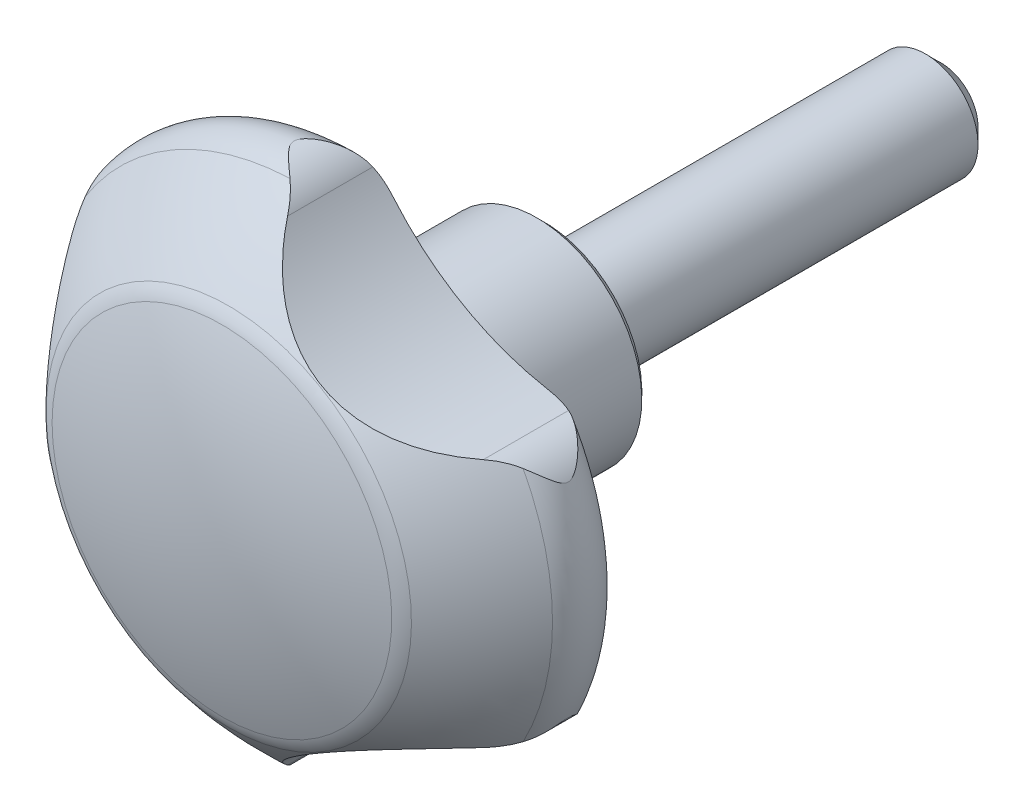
ISO-10303-21;
HEADER;
FILE_DESCRIPTION(('STEP AP214'),'2;1');
FILE_NAME('part.step','',(''),(''),'','','');
FILE_SCHEMA(('AUTOMOTIVE_DESIGN { 1 0 10303 214 1 1 1 1 }'));
ENDSEC;
DATA;
#1=APPLICATION_CONTEXT('core data for automotive mechanical design processes');
#2=APPLICATION_PROTOCOL_DEFINITION('international standard','automotive_design',2000,#1);
#3=PRODUCT_CONTEXT('',#1,'mechanical');
#4=PRODUCT('Part','Part','',(#3));
#5=PRODUCT_RELATED_PRODUCT_CATEGORY('part','',(#4));
#6=PRODUCT_DEFINITION_FORMATION('','',#4);
#7=PRODUCT_DEFINITION_CONTEXT('part definition',#1,'design');
#8=PRODUCT_DEFINITION('design','',#6,#7);
#9=PRODUCT_DEFINITION_SHAPE('','',#8);
#10=(LENGTH_UNIT() NAMED_UNIT(*) SI_UNIT(.MILLI.,.METRE.));
#11=(NAMED_UNIT(*) PLANE_ANGLE_UNIT() SI_UNIT($,.RADIAN.));
#12=(NAMED_UNIT(*) SI_UNIT($,.STERADIAN.) SOLID_ANGLE_UNIT());
#13=UNCERTAINTY_MEASURE_WITH_UNIT(LENGTH_MEASURE(1.E-05),#10,'distance_accuracy_value','');
#14=(GEOMETRIC_REPRESENTATION_CONTEXT(3) GLOBAL_UNCERTAINTY_ASSIGNED_CONTEXT((#13)) GLOBAL_UNIT_ASSIGNED_CONTEXT((#10,
#11,#12)) REPRESENTATION_CONTEXT('',''));
#15=CARTESIAN_POINT('',(0.,0.,0.));
#16=DIRECTION('',(0.,0.,1.));
#17=DIRECTION('',(1.,0.,0.));
#18=AXIS2_PLACEMENT_3D('',#15,#16,#17);
#19=CARTESIAN_POINT('',(0.,0.,16.875));
#20=DIRECTION('',(0.,0.,1.));
#21=DIRECTION('',(0.,-1.,0.));
#22=AXIS2_PLACEMENT_3D('',#19,#20,#21);
#23=TOROIDAL_SURFACE('',#22,16.625,3.375);
#24=CARTESIAN_POINT('',(0.,0.,13.5));
#25=DIRECTION('',(0.,0.,1.));
#26=DIRECTION('',(0.,-1.,0.));
#27=AXIS2_PLACEMENT_3D('',#24,#25,#26);
#28=CIRCLE('',#27,16.625);
#29=CARTESIAN_POINT('',(-15.1822150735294,-6.77428745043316,13.5));
#30=VERTEX_POINT('',#29);
#31=CARTESIAN_POINT('',(1.72440251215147,-16.5353276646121,13.5));
#32=VERTEX_POINT('',#31);
#33=EDGE_CURVE('E354',#30,#32,#28,.T.);
#34=ORIENTED_EDGE('',*,*,#33,.T.);
#35=CARTESIAN_POINT('',(15.4379786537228,-9.50595479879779,13.8541043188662));
#36=CARTESIAN_POINT('',(15.3037212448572,-9.51645099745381,13.7998826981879));
#37=CARTESIAN_POINT('',(15.1669261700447,-9.5285522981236,13.7526191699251));
#38=CARTESIAN_POINT('',(14.8901147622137,-9.55598611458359,13.6711535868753));
#39=CARTESIAN_POINT('',(14.7501059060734,-9.57131169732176,13.636923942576));
#40=CARTESIAN_POINT('',(14.4703418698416,-9.60499380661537,13.5808904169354));
#41=CARTESIAN_POINT('',(14.3306169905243,-9.62329916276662,13.5589005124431));
#42=CARTESIAN_POINT('',(14.0503009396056,-9.66307090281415,13.5254626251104));
#43=CARTESIAN_POINT('',(13.9097092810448,-9.68453925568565,13.5140212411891));
#44=CARTESIAN_POINT('',(13.5604307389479,-9.74171564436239,13.4973647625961));
#45=CARTESIAN_POINT('',(13.3517720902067,-9.77928160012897,13.4978565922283));
#46=CARTESIAN_POINT('',(12.9364664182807,-9.86087598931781,13.5161913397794));
#47=CARTESIAN_POINT('',(12.7298209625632,-9.90490908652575,13.5340468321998));
#48=CARTESIAN_POINT('',(12.3174684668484,-9.999577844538,13.5840167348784));
#49=CARTESIAN_POINT('',(12.1117957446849,-10.0502797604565,13.6162832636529));
#50=CARTESIAN_POINT('',(11.7042001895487,-10.1575906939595,13.6918190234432));
#51=CARTESIAN_POINT('',(11.5022759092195,-10.214197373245,13.7350839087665));
#52=CARTESIAN_POINT('',(10.9825776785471,-10.3686503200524,13.8577332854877));
#53=CARTESIAN_POINT('',(10.6675934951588,-10.4709447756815,13.9432631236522));
#54=CARTESIAN_POINT('',(10.2004875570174,-10.63545399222,14.0771430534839));
#55=CARTESIAN_POINT('',(10.0455515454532,-10.6921878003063,14.1227415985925));
#56=CARTESIAN_POINT('',(9.73714627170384,-10.8094624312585,14.2140018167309));
#57=CARTESIAN_POINT('',(9.58367689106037,-10.870002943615,14.2596634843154));
#58=CARTESIAN_POINT('',(9.28009247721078,-10.9941316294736,14.3483981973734));
#59=CARTESIAN_POINT('',(9.12996163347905,-11.0576605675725,14.3914997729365));
#60=CARTESIAN_POINT('',(8.83034428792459,-11.1888108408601,14.473670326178));
#61=CARTESIAN_POINT('',(8.68085784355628,-11.2564325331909,14.5127389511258));
#62=CARTESIAN_POINT('',(8.38263736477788,-11.3958170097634,14.5843050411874));
#63=CARTESIAN_POINT('',(8.23390239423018,-11.4675701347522,14.6168170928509));
#64=CARTESIAN_POINT('',(7.93690468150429,-11.6154557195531,14.6727872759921));
#65=CARTESIAN_POINT('',(7.78864179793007,-11.6915867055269,14.6962484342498));
#66=CARTESIAN_POINT('',(7.53921789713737,-11.8236597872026,14.7262894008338));
#67=CARTESIAN_POINT('',(7.43781839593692,-11.8784750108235,14.7358536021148));
#68=CARTESIAN_POINT('',(7.23569510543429,-11.9900171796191,14.7491398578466));
#69=CARTESIAN_POINT('',(7.13497124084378,-12.0467439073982,14.7528625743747));
#70=CARTESIAN_POINT('',(6.93446874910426,-12.161968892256,14.7542555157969));
#71=CARTESIAN_POINT('',(6.83469034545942,-12.2204675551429,14.7519243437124));
#72=CARTESIAN_POINT('',(6.63639652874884,-12.3390439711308,14.7413391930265));
#73=CARTESIAN_POINT('',(6.53788114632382,-12.3991217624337,14.733085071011));
#74=CARTESIAN_POINT('',(6.34135670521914,-12.5213047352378,14.7109864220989));
#75=CARTESIAN_POINT('',(6.24336300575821,-12.5834243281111,14.6970858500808));
#76=CARTESIAN_POINT('',(6.04904039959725,-12.7089780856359,14.6643869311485));
#77=CARTESIAN_POINT('',(5.95271178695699,-12.7724124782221,14.6455877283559));
#78=CARTESIAN_POINT('',(5.66623604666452,-12.9646113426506,14.5830663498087));
#79=CARTESIAN_POINT('',(5.47866922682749,-13.0952277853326,14.5332294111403));
#80=CARTESIAN_POINT('',(5.15344663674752,-13.3299828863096,14.436931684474));
#81=CARTESIAN_POINT('',(5.01443996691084,-13.4331124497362,14.3924401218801));
#82=CARTESIAN_POINT('',(4.73971969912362,-13.642479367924,14.3006111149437));
#83=CARTESIAN_POINT('',(4.60400649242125,-13.7487170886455,14.2532733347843));
#84=CARTESIAN_POINT('',(4.3354008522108,-13.9646299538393,14.158085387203));
#85=CARTESIAN_POINT('',(4.20250995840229,-14.0743068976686,14.1102349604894));
#86=CARTESIAN_POINT('',(3.93928289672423,-14.2973419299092,14.0161154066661));
#87=CARTESIAN_POINT('',(3.80894682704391,-14.4107001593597,13.969846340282));
#88=CARTESIAN_POINT('',(3.42301483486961,-14.7552752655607,13.8368224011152));
#89=CARTESIAN_POINT('',(3.1707686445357,-14.9923790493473,13.7551864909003));
#90=CARTESIAN_POINT('',(2.67547480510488,-15.4831619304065,13.6198975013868));
#91=CARTESIAN_POINT('',(2.43241124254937,-15.7368100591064,13.5661937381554));
#92=CARTESIAN_POINT('',(1.9838165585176,-16.2307686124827,13.5051034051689));
#93=CARTESIAN_POINT('',(1.77713561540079,-16.4693787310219,13.4931932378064));
#94=CARTESIAN_POINT('',(1.47663315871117,-16.833363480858,13.5091853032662));
#95=CARTESIAN_POINT('',(1.37809953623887,-16.9556400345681,13.5201448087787));
#96=CARTESIAN_POINT('',(1.18481238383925,-17.2013258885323,13.5547877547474));
#97=CARTESIAN_POINT('',(1.09005659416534,-17.3247344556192,13.5784634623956));
#98=CARTESIAN_POINT('',(0.912640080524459,-17.5613943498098,13.6374382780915));
#99=CARTESIAN_POINT('',(0.82962387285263,-17.6746511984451,13.67162881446));
#100=CARTESIAN_POINT('',(0.667982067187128,-17.8999656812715,13.7529327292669));
#101=CARTESIAN_POINT('',(0.589364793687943,-18.0120207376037,13.8000696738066));
#102=CARTESIAN_POINT('',(0.513385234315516,-18.1226937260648,13.854121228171));
#103=B_SPLINE_CURVE_WITH_KNOTS('',3,(#35,#36,#37,#38,#39,#40,#41,#42,#43,#44,#45,#46,#47,#48,
#49,#50,#51,#52,#53,#54,#55,#56,#57,#58,#59,#60,#61,#62,#63,#64,#65,#66,#67,#68,#69,#70,#71,#72,
#73,#74,#75,#76,#77,#78,#79,#80,#81,#82,#83,#84,#85,#86,#87,#88,#89,#90,#91,#92,#93,#94,#95,#96,
#97,#98,#99,#100,#101,#102),.UNSPECIFIED.,.F.,.F.,(4,2,2,2,2,2,2,2,2,2,2,2,2,2,2,2,2,2,2,2,2,2,
2,2,2,2,2,2,2,2,2,2,2,4),(0.,0.43512627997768,0.869326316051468,1.29673327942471,
1.72440743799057,2.35940170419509,2.99485616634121,3.63718292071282,4.27925627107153,
5.30456736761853,5.81809451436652,6.33157982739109,6.83737353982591,7.34321145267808,
7.84791129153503,8.35244220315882,8.69928448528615,9.0460874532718,9.39297045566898,
9.73986185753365,10.0902839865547,10.4407673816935,11.1419829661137,11.6780504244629,
12.2141812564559,12.7505974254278,13.2870341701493,14.352982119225,15.4169890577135,
16.3615250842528,16.8333167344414,17.3048218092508,17.7377773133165,18.1715262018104),.UNSPECIFIED.);
#104=CARTESIAN_POINT('',(0.513522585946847,-18.1224937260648,13.8540235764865));
#105=VERTEX_POINT('',#104);
#106=EDGE_CURVE('E151',#32,#105,#103,.T.);
#107=ORIENTED_EDGE('',*,*,#106,.T.);
#108=CARTESIAN_POINT('',(-0.717939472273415,-19.2832689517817,18.9372857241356));
#109=CARTESIAN_POINT('',(-0.817379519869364,-19.3432731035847,18.8547399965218));
#110=CARTESIAN_POINT('',(-0.918151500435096,-19.398116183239,18.7701038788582));
#111=CARTESIAN_POINT('',(-1.12111838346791,-19.4978445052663,18.5964610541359));
#112=CARTESIAN_POINT('',(-1.22331497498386,-19.54271662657,18.5074487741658));
#113=CARTESIAN_POINT('',(-1.42803631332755,-19.6228738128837,18.3247102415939));
#114=CARTESIAN_POINT('',(-1.53056071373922,-19.6581193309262,18.2309663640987));
#115=CARTESIAN_POINT('',(-1.73342131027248,-19.7190945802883,18.0382837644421));
#116=CARTESIAN_POINT('',(-1.83375959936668,-19.7448338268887,17.9393503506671));
#117=CARTESIAN_POINT('',(-1.98769349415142,-19.7784352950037,17.7764481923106));
#118=CARTESIAN_POINT('',(-2.04336920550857,-19.7892799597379,17.7150560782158));
#119=CARTESIAN_POINT('',(-2.1509373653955,-19.8080166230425,17.5883778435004));
#120=CARTESIAN_POINT('',(-2.2028252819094,-19.8159051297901,17.5230872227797));
#121=CARTESIAN_POINT('',(-2.28824210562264,-19.8273856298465,17.4024525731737));
#122=CARTESIAN_POINT('',(-2.32325949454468,-19.8315471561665,17.348234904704));
#123=CARTESIAN_POINT('',(-2.38559924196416,-19.8382748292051,17.2354517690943));
#124=CARTESIAN_POINT('',(-2.41295244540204,-19.8408474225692,17.1769049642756));
#125=CARTESIAN_POINT('',(-2.44702989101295,-19.843843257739,17.0774131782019));
#126=CARTESIAN_POINT('',(-2.45763984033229,-19.8447083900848,17.0378537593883));
#127=CARTESIAN_POINT('',(-2.47204409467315,-19.8458612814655,16.957522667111));
#128=CARTESIAN_POINT('',(-2.47585221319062,-19.8461502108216,16.9167536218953));
#129=CARTESIAN_POINT('',(-2.47597002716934,-19.8461593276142,16.8350871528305));
#130=CARTESIAN_POINT('',(-2.4722582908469,-19.8458778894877,16.7941896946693));
#131=CARTESIAN_POINT('',(-2.45799116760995,-19.8447369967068,16.7136042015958));
#132=CARTESIAN_POINT('',(-2.4474231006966,-19.8438764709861,16.6739185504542));
#133=CARTESIAN_POINT('',(-2.41334831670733,-19.8408842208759,16.5739659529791));
#134=CARTESIAN_POINT('',(-2.38589258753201,-19.8383048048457,16.5151006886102));
#135=CARTESIAN_POINT('',(-2.32323417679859,-19.8315461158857,16.4016974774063));
#136=CARTESIAN_POINT('',(-2.28799501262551,-19.8273592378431,16.3471816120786));
#137=CARTESIAN_POINT('',(-2.1886918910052,-19.8139942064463,16.20698075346));
#138=CARTESIAN_POINT('',(-2.12082742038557,-19.8033419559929,16.1241785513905));
#139=CARTESIAN_POINT('',(-1.97976163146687,-19.7770498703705,15.9640107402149));
#140=CARTESIAN_POINT('',(-1.90654811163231,-19.7613983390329,15.8866584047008));
#141=CARTESIAN_POINT('',(-1.75721685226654,-19.7248160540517,15.7354479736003));
#142=CARTESIAN_POINT('',(-1.68108815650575,-19.703863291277,15.6616060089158));
#143=CARTESIAN_POINT('',(-1.52779044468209,-19.6565655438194,15.5169677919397));
#144=CARTESIAN_POINT('',(-1.45062246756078,-19.6302256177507,15.4461687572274));
#145=CARTESIAN_POINT('',(-1.26477673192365,-19.5601948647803,15.2789511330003));
#146=CARTESIAN_POINT('',(-1.15599265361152,-19.5137970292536,15.1837670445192));
#147=CARTESIAN_POINT('',(-0.939748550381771,-19.4096395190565,14.9980807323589));
#148=CARTESIAN_POINT('',(-0.832289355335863,-19.3518730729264,14.907581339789));
#149=CARTESIAN_POINT('',(-0.62074782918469,-19.224984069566,14.732076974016));
#150=CARTESIAN_POINT('',(-0.516650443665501,-19.155924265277,14.6470450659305));
#151=CARTESIAN_POINT('',(-0.31262734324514,-19.0059523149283,14.4826321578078));
#152=CARTESIAN_POINT('',(-0.21270125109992,-18.9250412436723,14.4032506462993));
#153=CARTESIAN_POINT('',(-0.00138552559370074,-18.7358270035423,14.2377558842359));
#154=CARTESIAN_POINT('',(0.10895095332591,-18.6252080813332,14.1528947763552));
#155=CARTESIAN_POINT('',(0.266841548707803,-18.4464783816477,14.0340195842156));
#156=CARTESIAN_POINT('',(0.318314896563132,-18.3846073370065,13.9957170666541));
#157=CARTESIAN_POINT('',(0.418305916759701,-18.2566207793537,13.9223190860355));
#158=CARTESIAN_POINT('',(0.466821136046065,-18.1905018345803,13.8872262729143));
#159=CARTESIAN_POINT('',(0.513659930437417,-18.1222937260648,13.8539259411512));
#160=B_SPLINE_CURVE_WITH_KNOTS('',3,(#108,#109,#110,#111,#112,#113,#114,#115,#116,#117,#118,
#119,#120,#121,#122,#123,#124,#125,#126,#127,#128,#129,#130,#131,#132,#133,#134,#135,#136,#137,
#138,#139,#140,#141,#142,#143,#144,#145,#146,#147,#148,#149,#150,#151,#152,#153,#154,#155,#156,
#157,#158,#159),.UNSPECIFIED.,.F.,.F.,(4,2,2,2,2,2,2,2,2,2,2,2,2,2,2,2,2,2,2,2,2,2,2,2,2,4),(0.,
0.427303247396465,0.855165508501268,1.28475989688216,1.71392311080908,1.96454616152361,
2.21546432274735,2.40917167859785,2.6020878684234,2.7245104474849,2.84668412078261,
2.96920648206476,3.09195608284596,3.28584534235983,3.48066345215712,3.80264995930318,
4.125395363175,4.44950335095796,4.77330838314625,5.22823004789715,5.68342350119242,
6.13616858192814,6.58887262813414,7.12078134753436,7.38799730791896,7.65543192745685),.UNSPECIFIED.);
#161=CARTESIAN_POINT('',(-0.718180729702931,-19.2834144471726,18.9370857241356));
#162=VERTEX_POINT('',#161);
#163=EDGE_CURVE('E146',#162,#105,#160,.T.);
#164=ORIENTED_EDGE('',*,*,#163,.F.);
#165=CARTESIAN_POINT('',(0.,0.,18.9370857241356));
#166=DIRECTION('',(0.,0.,1.));
#167=DIRECTION('',(0.,-1.,0.));
#168=AXIS2_PLACEMENT_3D('',#165,#166,#167);
#169=CIRCLE('',#168,19.2967835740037);
#170=CARTESIAN_POINT('',(-16.3408364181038,-10.2636699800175,18.9370857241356));
#171=VERTEX_POINT('',#170);
#172=EDGE_CURVE('E360',#171,#162,#169,.T.);
#173=ORIENTED_EDGE('',*,*,#172,.F.);
#174=CARTESIAN_POINT('',(-15.9512057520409,-8.61632325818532,13.85393438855));
#175=CARTESIAN_POINT('',(-16.0093028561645,-8.737994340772,13.9082231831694));
#176=CARTESIAN_POINT('',(-16.060350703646,-8.86072630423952,13.9672208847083));
#177=CARTESIAN_POINT('',(-16.14897200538,-9.10667626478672,14.0931003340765));
#178=CARTESIAN_POINT('',(-16.1865737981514,-9.22989267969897,14.1599651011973));
#179=CARTESIAN_POINT('',(-16.2490254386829,-9.47514620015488,14.2999689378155));
#180=CARTESIAN_POINT('',(-16.2739323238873,-9.59718611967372,14.3730781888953));
#181=CARTESIAN_POINT('',(-16.312066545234,-9.83966938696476,14.5248830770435));
#182=CARTESIAN_POINT('',(-16.3252874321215,-9.96011181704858,14.6035817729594));
#183=CARTESIAN_POINT('',(-16.3414570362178,-10.2078052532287,14.7722047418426));
#184=CARTESIAN_POINT('',(-16.3435129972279,-10.334843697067,14.8625247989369));
#185=CARTESIAN_POINT('',(-16.336009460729,-10.5848023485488,15.0482599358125));
#186=CARTESIAN_POINT('',(-16.3264474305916,-10.7077216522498,15.1436761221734));
#187=CARTESIAN_POINT('',(-16.2969095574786,-10.9479894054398,15.3394481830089));
#188=CARTESIAN_POINT('',(-16.2769460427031,-11.0653442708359,15.4397980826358));
#189=CARTESIAN_POINT('',(-16.2281050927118,-11.2928347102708,15.646235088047));
#190=CARTESIAN_POINT('',(-16.1992353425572,-11.4029764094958,15.7523171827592));
#191=CARTESIAN_POINT('',(-16.1493571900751,-11.5664047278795,15.9245079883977));
#192=CARTESIAN_POINT('',(-16.1304655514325,-11.6234147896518,15.9877083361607));
#193=CARTESIAN_POINT('',(-16.0916521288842,-11.7327235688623,16.1179814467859));
#194=CARTESIAN_POINT('',(-16.0717293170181,-11.7850174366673,16.1850580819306));
#195=CARTESIAN_POINT('',(-16.0366015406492,-11.8722875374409,16.3108301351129));
#196=CARTESIAN_POINT('',(-16.0212499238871,-11.9086355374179,16.3685187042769));
#197=CARTESIAN_POINT('',(-15.9929667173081,-11.9733734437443,16.4887986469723));
#198=CARTESIAN_POINT('',(-15.9800259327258,-12.0017938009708,16.5513700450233));
#199=CARTESIAN_POINT('',(-15.9639727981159,-12.0363977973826,16.6554709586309));
#200=CARTESIAN_POINT('',(-15.9590035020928,-12.046924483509,16.6952167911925));
#201=CARTESIAN_POINT('',(-15.9519431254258,-12.0618077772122,16.7760642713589));
#202=CARTESIAN_POINT('',(-15.9498449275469,-12.0661796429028,16.8171623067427));
#203=CARTESIAN_POINT('',(-15.9489671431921,-12.0680139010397,16.8997426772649));
#204=CARTESIAN_POINT('',(-15.9502024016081,-12.0654453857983,16.9412259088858));
#205=CARTESIAN_POINT('',(-15.9557420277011,-12.0538107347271,17.0230710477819));
#206=CARTESIAN_POINT('',(-15.9600518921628,-12.0447329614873,17.0634308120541));
#207=CARTESIAN_POINT('',(-15.9737226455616,-12.0154681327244,17.1624272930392));
#208=CARTESIAN_POINT('',(-15.9845397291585,-11.9919731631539,17.2198462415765));
#209=CARTESIAN_POINT('',(-16.0087265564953,-11.9375757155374,17.3305586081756));
#210=CARTESIAN_POINT('',(-16.0221088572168,-11.9066365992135,17.3838298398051));
#211=CARTESIAN_POINT('',(-16.0584086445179,-11.8191710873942,17.519682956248));
#212=CARTESIAN_POINT('',(-16.0820171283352,-11.7588131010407,17.5995627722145));
#213=CARTESIAN_POINT('',(-16.1279945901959,-11.6311833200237,17.7540647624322));
#214=CARTESIAN_POINT('',(-16.1503604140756,-11.5638950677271,17.8286736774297));
#215=CARTESIAN_POINT('',(-16.1924155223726,-11.4243786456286,17.9744739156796));
#216=CARTESIAN_POINT('',(-16.2120945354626,-11.3521330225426,18.0456514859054));
#217=CARTESIAN_POINT('',(-16.2477973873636,-11.2041859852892,18.1850918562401));
#218=CARTESIAN_POINT('',(-16.2638251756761,-11.128488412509,18.2533577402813));
#219=CARTESIAN_POINT('',(-16.2891263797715,-10.9885286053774,18.3750655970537));
#220=CARTESIAN_POINT('',(-16.299100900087,-10.924743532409,18.4289123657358));
#221=CARTESIAN_POINT('',(-16.3160522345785,-10.7955359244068,18.5351218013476));
#222=CARTESIAN_POINT('',(-16.3230284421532,-10.7301130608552,18.5874841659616));
#223=CARTESIAN_POINT('',(-16.333731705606,-10.5984731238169,18.6902701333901));
#224=CARTESIAN_POINT('',(-16.3374881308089,-10.5322689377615,18.7407071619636));
#225=CARTESIAN_POINT('',(-16.3416872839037,-10.3986743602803,18.8401076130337));
#226=CARTESIAN_POINT('',(-16.3421304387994,-10.3312841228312,18.8890712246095));
#227=CARTESIAN_POINT('',(-16.340831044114,-10.2633882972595,18.9372857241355));
#228=B_SPLINE_CURVE_WITH_KNOTS('',3,(#174,#175,#176,#177,#178,#179,#180,#181,#182,#183,#184,
#185,#186,#187,#188,#189,#190,#191,#192,#193,#194,#195,#196,#197,#198,#199,#200,#201,#202,#203,
#204,#205,#206,#207,#208,#209,#210,#211,#212,#213,#214,#215,#216,#217,#218,#219,#220,#221,#222,
#223,#224,#225,#226,#227),.UNSPECIFIED.,.F.,.F.,(4,2,2,2,2,2,2,2,2,2,2,2,2,2,2,2,2,2,2,2,2,2,2,
2,2,2,4),(0.,0.435551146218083,0.870178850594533,1.30283619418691,1.73573216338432,
2.20278289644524,2.66993546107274,3.13653559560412,3.60273422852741,3.86416270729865,
4.12585701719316,4.33521208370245,4.54375156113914,4.66753533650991,4.79101170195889,
4.91503885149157,5.03928829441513,5.22712917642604,5.41591418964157,5.72375561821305,
6.03234572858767,6.34208434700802,6.65148631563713,6.9036125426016,7.15578975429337,
7.4056414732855,7.6554609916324),.UNSPECIFIED.);
#229=CARTESIAN_POINT('',(-15.9513012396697,-8.61652325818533,13.8540235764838));
#230=VERTEX_POINT('',#229);
#231=EDGE_CURVE('E141',#230,#171,#228,.T.);
#232=ORIENTED_EDGE('',*,*,#231,.F.);
#233=CARTESIAN_POINT('',(-15.9513967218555,-8.61672325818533,13.8541127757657));
#234=CARTESIAN_POINT('',(-15.8933579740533,-8.49520512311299,13.7998904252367));
#235=CARTESIAN_POINT('',(-15.8354404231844,-8.3706867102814,13.7526261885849));
#236=CARTESIAN_POINT('',(-15.7207929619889,-8.11724451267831,13.6711592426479));
#237=CARTESIAN_POINT('',(-15.6640607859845,-7.98833066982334,13.6369289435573));
#238=CARTESIAN_POINT('',(-15.553348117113,-7.72920714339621,13.5808941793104));
#239=CARTESIAN_POINT('',(-15.4993384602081,-7.5990492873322,13.5589036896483));
#240=CARTESIAN_POINT('',(-15.3936235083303,-7.33640278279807,13.5254646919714));
#241=CARTESIAN_POINT('',(-15.3419196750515,-7.20391272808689,13.5140227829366));
#242=CARTESIAN_POINT('',(-15.2167967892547,-6.87284203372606,13.4973651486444));
#243=CARTESIAN_POINT('',(-15.1450008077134,-6.67335688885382,13.4978562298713));
#244=CARTESIAN_POINT('',(-15.0080112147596,-6.27289743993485,13.516189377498));
#245=CARTESIAN_POINT('',(-14.9428224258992,-6.07192216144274,13.5340440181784));
#246=CARTESIAN_POINT('',(-14.8186319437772,-5.66748299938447,13.58401216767));
#247=CARTESIAN_POINT('',(-14.7597047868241,-5.46401570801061,13.6162777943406));
#248=CARTESIAN_POINT('',(-14.648841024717,-5.05737505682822,13.6918117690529));
#249=CARTESIAN_POINT('',(-14.59690167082,-4.85420161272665,13.7350757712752));
#250=CARTESIAN_POINT('',(-14.4708109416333,-4.32690041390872,13.8577245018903));
#251=CARTESIAN_POINT('',(-14.4019069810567,-4.00296459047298,13.9432550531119));
#252=CARTESIAN_POINT('',(-14.310821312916,-3.51617796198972,14.0771364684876));
#253=CARTESIAN_POINT('',(-14.2824856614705,-3.35363039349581,14.1227355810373));
#254=CARTESIAN_POINT('',(-14.2298448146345,-3.02790199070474,14.2139970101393));
#255=CARTESIAN_POINT('',(-14.2055392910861,-2.86472120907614,14.25965932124));
#256=CARTESIAN_POINT('',(-14.1612448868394,-2.53974081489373,14.3483953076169));
#257=CARTESIAN_POINT('',(-14.1411967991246,-2.37795712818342,14.3914975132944));
#258=CARTESIAN_POINT('',(-14.1049670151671,-2.05290153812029,14.4736692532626));
#259=CARTESIAN_POINT('',(-14.0887856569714,-1.88962950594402,14.5127384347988));
#260=CARTESIAN_POINT('',(-14.0603855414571,-1.56166647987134,14.584305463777));
#261=CARTESIAN_POINT('',(-14.0481579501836,-1.39697950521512,14.6168178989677));
#262=CARTESIAN_POINT('',(-14.0277316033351,-1.06582480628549,14.6727885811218));
#263=CARTESIAN_POINT('',(-14.0195315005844,-0.899357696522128,14.6962498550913));
#264=CARTESIAN_POINT('',(-14.0091982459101,-0.617310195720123,14.726290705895));
#265=CARTESIAN_POINT('',(-14.0059699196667,-0.502086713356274,14.735854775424));
#266=CARTESIAN_POINT('',(-14.0015067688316,-0.271269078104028,14.7491406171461));
#267=CARTESIAN_POINT('',(-14.0002717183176,-0.155674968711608,14.7528630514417));
#268=CARTESIAN_POINT('',(-13.9998084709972,0.0755804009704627,14.7542552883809));
#269=CARTESIAN_POINT('',(-14.0005807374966,0.1912416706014,14.7519236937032));
#270=CARTESIAN_POINT('',(-14.0041243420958,0.422259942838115,14.7413375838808));
#271=CARTESIAN_POINT('',(-14.0068957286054,0.537616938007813,14.7330829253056));
#272=CARTESIAN_POINT('',(-14.0144474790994,0.768906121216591,14.710983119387));
#273=CARTESIAN_POINT('',(-14.0192480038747,0.884832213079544,14.6970819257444));
#274=CARTESIAN_POINT('',(-14.0308199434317,1.11589989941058,14.6643817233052));
#275=CARTESIAN_POINT('',(-14.0375917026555,1.23104135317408,14.6455818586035));
#276=CARTESIAN_POINT('',(-14.0608038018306,1.57523971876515,14.5830584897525));
#277=CARTESIAN_POINT('',(-14.0801382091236,1.80298796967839,14.5332202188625));
#278=CARTESIAN_POINT('',(-14.12083142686,2.20201415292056,14.4369219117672));
#279=CARTESIAN_POINT('',(-14.1406406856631,2.37395752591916,14.3924312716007));
#280=CARTESIAN_POINT('',(-14.1845969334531,2.71654638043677,14.3006044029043));
#281=CARTESIAN_POINT('',(-14.2087444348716,2.88719170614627,14.253267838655));
#282=CARTESIAN_POINT('',(-14.2614264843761,3.22775824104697,14.1580824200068));
#283=CARTESIAN_POINT('',(-14.2899633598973,3.39767901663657,14.1102333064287));
#284=CARTESIAN_POINT('',(-14.3515021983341,3.73714870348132,14.0161162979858));
#285=CARTESIAN_POINT('',(-14.3845043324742,3.90669760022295,13.9698484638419));
#286=CARTESIAN_POINT('',(-14.4899459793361,4.41319851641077,13.8368278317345));
#287=CARTESIAN_POINT('',(-14.5691582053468,4.75019302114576,13.755193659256));
#288=CARTESIAN_POINT('',(-14.7465355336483,5.42450354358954,13.6199060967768));
#289=CARTESIAN_POINT('',(-14.8446658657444,5.76181785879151,13.5662020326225));
#290=CARTESIAN_POINT('',(-15.0481450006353,6.39728605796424,13.5051069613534));
#291=CARTESIAN_POINT('',(-15.1514470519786,6.69558548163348,13.4931939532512));
#292=CARTESIAN_POINT('',(-15.3164163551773,7.13782595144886,13.509181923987));
#293=CARTESIAN_POINT('',(-15.3730443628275,7.28429865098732,13.5201400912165));
#294=CARTESIAN_POINT('',(-15.4891715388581,7.5745368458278,13.5547804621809));
#295=CARTESIAN_POINT('',(-15.5486689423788,7.71830393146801,13.5784549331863));
#296=CARTESIAN_POINT('',(-15.6649160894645,7.99028741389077,13.6374281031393));
#297=CARTESIAN_POINT('',(-15.7214928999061,8.11881435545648,13.671618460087));
#298=CARTESIAN_POINT('',(-15.8358034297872,8.37146611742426,13.7529227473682));
#299=CARTESIAN_POINT('',(-15.8935390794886,8.49558243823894,13.8000602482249));
#300=CARTESIAN_POINT('',(-15.9513967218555,8.61672325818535,13.8541127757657));
#301=B_SPLINE_CURVE_WITH_KNOTS('',3,(#233,#234,#235,#236,#237,#238,#239,#240,#241,#242,#243,
#244,#245,#246,#247,#248,#249,#250,#251,#252,#253,#254,#255,#256,#257,#258,#259,#260,#261,#262,
#263,#264,#265,#266,#267,#268,#269,#270,#271,#272,#273,#274,#275,#276,#277,#278,#279,#280,#281,
#282,#283,#284,#285,#286,#287,#288,#289,#290,#291,#292,#293,#294,#295,#296,#297,#298,#299,#300),
.UNSPECIFIED.,.F.,.F.,(4,2,2,2,2,2,2,2,2,2,2,2,2,2,2,2,2,2,2,2,2,2,2,2,2,2,2,2,2,2,2,2,2,4),(0.,
0.435126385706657,0.869326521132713,1.29673356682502,1.72440780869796,2.35939750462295,
2.99484738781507,3.6371695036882,4.27923821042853,5.30456286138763,5.81809684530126,
6.33158899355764,6.83738933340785,7.34323387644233,7.84794026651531,8.35247771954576,
8.69932392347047,9.04613081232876,9.39301775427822,9.73991309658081,10.0903392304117,
10.440826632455,11.1420502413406,11.6781033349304,12.2142197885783,12.7506215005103,
13.2870437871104,14.3529633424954,15.416942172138,16.3614882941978,16.8332849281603,
17.3047949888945,17.7377638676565,18.1715262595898),.UNSPECIFIED.);
#302=EDGE_CURVE('E132',#230,#30,#301,.T.);
#303=ORIENTED_EDGE('',*,*,#302,.T.);
#304=EDGE_LOOP('',(#34,#107,#164,#173,#232,#303));
#305=FACE_BOUND('',#304,.T.);
#306=ADVANCED_FACE('F14',(#305),#23,.T.);
#307=CARTESIAN_POINT('',(0.513659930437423,18.1222937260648,13.8539259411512));
#308=CARTESIAN_POINT('',(0.437338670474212,18.2334434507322,13.9082142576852));
#309=CARTESIAN_POINT('',(0.356573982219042,18.3390187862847,13.967211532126));
#310=CARTESIAN_POINT('',(0.187886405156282,18.5387433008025,14.0930902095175));
#311=CARTESIAN_POINT('',(0.0999790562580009,18.6329162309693,14.1599546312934));
#312=CARTESIAN_POINT('',(-0.0811903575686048,18.8096288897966,14.2999578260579));
#313=CARTESIAN_POINT('',(-0.174426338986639,18.8922194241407,14.3730667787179));
#314=CARTESIAN_POINT('',(-0.365355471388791,19.0464874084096,14.5248711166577));
#315=CARTESIAN_POINT('',(-0.463051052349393,19.1181588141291,14.6035695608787));
#316=CARTESIAN_POINT('',(-0.66947455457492,19.256009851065,14.7721918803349));
#317=CARTESIAN_POINT('',(-0.778464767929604,19.3213100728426,14.8625115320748));
#318=CARTESIAN_POINT('',(-0.998686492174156,19.4397921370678,15.0482458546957));
#319=CARTESIAN_POINT('',(-1.10991848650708,19.4929713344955,15.1436616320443));
#320=CARTESIAN_POINT('',(-1.33276498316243,19.587525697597,15.3394328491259));
#321=CARTESIAN_POINT('',(-1.44437887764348,19.6289147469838,15.4397823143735));
#322=CARTESIAN_POINT('',(-1.66581169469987,19.7003635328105,15.6462183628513));
#323=CARTESIAN_POINT('',(-1.77563207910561,19.7304329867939,15.7522999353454));
#324=CARTESIAN_POINT('',(-1.94210548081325,19.768952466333,15.9244907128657));
#325=CARTESIAN_POINT('',(-2.0009245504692,19.7810973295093,15.9876916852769));
#326=CARTESIAN_POINT('',(-2.1149977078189,19.8021391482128,16.1179660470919));
#327=CARTESIAN_POINT('',(-2.17024810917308,19.8110327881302,16.1850433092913));
#328=CARTESIAN_POINT('',(-2.26339292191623,19.8242469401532,16.3108172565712));
#329=CARTESIAN_POINT('',(-2.30254856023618,19.8291263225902,16.3685071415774));
#330=CARTESIAN_POINT('',(-2.37275774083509,19.8370017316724,16.4887899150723));
#331=CARTESIAN_POINT('',(-2.4038422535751,19.8400050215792,16.5513628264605));
#332=CARTESIAN_POINT('',(-2.44183813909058,19.8434047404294,16.6554654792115));
#333=CARTESIAN_POINT('',(-2.45343948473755,19.8443645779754,16.6952113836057));
#334=CARTESIAN_POINT('',(-2.46985963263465,19.8456918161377,16.7760590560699));
#335=CARTESIAN_POINT('',(-2.47469520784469,19.846060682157,16.8171572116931));
#336=CARTESIAN_POINT('',(-2.47672322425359,19.8462176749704,16.8997379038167));
#337=CARTESIAN_POINT('',(-2.47388147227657,19.8460032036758,16.9412213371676));
#338=CARTESIAN_POINT('',(-2.46103620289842,19.8449833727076,17.0230669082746));
#339=CARTESIAN_POINT('',(-2.45101985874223,19.8441769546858,17.0634269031));
#340=CARTESIAN_POINT('',(-2.41884096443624,19.8413838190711,17.1624231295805));
#341=CARTESIAN_POINT('',(-2.39308569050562,19.8390042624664,17.2198416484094));
#342=CARTESIAN_POINT('',(-2.33388374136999,19.8327520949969,17.3305532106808));
#343=CARTESIAN_POINT('',(-2.30039905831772,19.8288720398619,17.3838240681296));
#344=CARTESIAN_POINT('',(-2.20650345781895,19.8165761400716,17.5196758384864));
#345=CARTESIAN_POINT('',(-2.14242883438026,19.8068429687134,17.599554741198));
#346=CARTESIAN_POINT('',(-2.00891180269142,19.7828464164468,17.7540549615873));
#347=CARTESIAN_POINT('',(-1.93945671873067,19.7685720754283,17.8286630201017));
#348=CARTESIAN_POINT('',(-1.79760669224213,19.7352356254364,17.9744615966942));
#349=CARTESIAN_POINT('',(-1.72520176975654,19.7161558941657,18.0456383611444));
#350=CARTESIAN_POINT('',(-1.57922667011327,19.6731032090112,18.1850771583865));
#351=CARTESIAN_POINT('',(-1.50565784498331,19.6491355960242,18.2533422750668));
#352=CARTESIAN_POINT('',(-1.37179807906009,19.6010677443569,18.3750509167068));
#353=CARTESIAN_POINT('',(-1.31156981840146,19.5778131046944,18.4288991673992));
#354=CARTESIAN_POINT('',(-1.19119404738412,19.5278888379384,18.5351114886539));
#355=CARTESIAN_POINT('',(-1.13104655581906,19.5012185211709,18.587475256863));
#356=CARTESIAN_POINT('',(-1.01168839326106,19.44466678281,18.6902639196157));
#357=CARTESIAN_POINT('',(-0.952474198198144,19.4148172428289,18.7407022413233));
#358=CARTESIAN_POINT('',(-0.834675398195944,19.3516551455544,18.8401052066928));
#359=CARTESIAN_POINT('',(-0.776090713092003,19.318343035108,18.8890700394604));
#360=CARTESIAN_POINT('',(-0.717939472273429,19.2832689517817,18.9372857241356));
#361=B_SPLINE_CURVE_WITH_KNOTS('',3,(#307,#308,#309,#310,#311,#312,#313,#314,#315,#316,#317,
#318,#319,#320,#321,#322,#323,#324,#325,#326,#327,#328,#329,#330,#331,#332,#333,#334,#335,#336,
#337,#338,#339,#340,#341,#342,#343,#344,#345,#346,#347,#348,#349,#350,#351,#352,#353,#354,#355,
#356,#357,#358,#359,#360),.UNSPECIFIED.,.F.,.F.,(4,2,2,2,2,2,2,2,2,2,2,2,2,2,2,2,2,2,2,2,2,2,2,
2,2,2,4),(0.,0.435551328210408,0.870179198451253,1.3028365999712,1.73573263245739,
2.20278258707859,2.66993436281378,3.13653373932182,3.60273163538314,3.86416387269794,
4.12586198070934,4.33522294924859,4.54376827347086,4.66755253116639,4.7910293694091,
4.91505705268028,5.03930702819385,5.22714611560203,5.41592931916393,5.72376636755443,
6.03235208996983,6.34208636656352,6.65148399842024,6.90361654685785,7.1558000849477,
7.40565794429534,7.65548359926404),.UNSPECIFIED.);
#362=CARTESIAN_POINT('',(0.513522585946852,18.1224937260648,13.854023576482));
#363=VERTEX_POINT('',#362);
#364=CARTESIAN_POINT('',(-0.718180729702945,19.2834144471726,18.9370857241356));
#365=VERTEX_POINT('',#364);
#366=EDGE_CURVE('E278',#363,#365,#361,.T.);
#367=ORIENTED_EDGE('',*,*,#366,.F.);
#368=CARTESIAN_POINT('',(0.513385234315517,18.1226937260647,13.854121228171));
#369=CARTESIAN_POINT('',(0.589603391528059,18.0116717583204,13.7998981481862));
#370=CARTESIAN_POINT('',(0.668480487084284,17.8992545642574,13.7526332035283));
#371=CARTESIAN_POINT('',(0.830643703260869,17.6732459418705,13.6711648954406));
#372=CARTESIAN_POINT('',(0.913920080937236,17.5596575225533,13.6369339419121));
#373=CARTESIAN_POINT('',(1.08297094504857,17.3342157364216,13.5808979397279));
#374=CARTESIAN_POINT('',(1.16868596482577,17.2223630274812,13.5589068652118));
#375=CARTESIAN_POINT('',(1.34328674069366,16.9994878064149,13.5254667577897));
#376=CARTESIAN_POINT('',(1.43217444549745,16.888465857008,13.5140243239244));
#377=CARTESIAN_POINT('',(1.65632734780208,16.6145718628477,13.4973655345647));
#378=CARTESIAN_POINT('',(1.79318737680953,16.4526531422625,13.4978558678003));
#379=CARTESIAN_POINT('',(2.07149824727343,16.1337888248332,13.5161874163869));
#380=CARTESIAN_POINT('',(2.21295234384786,15.9768469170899,13.5340412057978));
#381=CARTESIAN_POINT('',(2.50110924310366,15.6670768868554,13.5840076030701));
#382=CARTESIAN_POINT('',(2.6478522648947,15.5143116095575,13.6162723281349));
#383=CARTESIAN_POINT('',(2.94457900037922,15.214981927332,13.6918045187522));
#384=CARTESIAN_POINT('',(3.09456141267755,15.0684150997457,13.7350676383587));
#385=CARTESIAN_POINT('',(3.48817385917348,14.6955637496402,13.8577157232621));
#386=CARTESIAN_POINT('',(3.73426151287,14.473919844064,13.9432469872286));
#387=CARTESIAN_POINT('',(4.1102928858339,14.151639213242,14.0771298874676));
#388=CARTESIAN_POINT('',(4.23689695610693,14.0458244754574,14.122729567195));
#389=CARTESIAN_POINT('',(4.49266880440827,13.8373689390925,14.2139922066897));
#390=CARTESIAN_POINT('',(4.62183637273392,13.7347278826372,14.259655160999));
#391=CARTESIAN_POINT('',(4.88113371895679,13.5338748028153,14.348392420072));
#392=CARTESIAN_POINT('',(5.01122009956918,13.4356194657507,14.3914952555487));
#393=CARTESIAN_POINT('',(5.27461497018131,13.2417131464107,14.4736681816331));
#394=CARTESIAN_POINT('',(5.40792374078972,13.1460623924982,14.5127379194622));
#395=CARTESIAN_POINT('',(5.67775151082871,12.9574831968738,14.5843058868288));
#396=CARTESIAN_POINT('',(5.8142626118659,12.8645491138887,14.6168187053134));
#397=CARTESIAN_POINT('',(6.09084149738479,12.6812797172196,14.6727898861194));
#398=CARTESIAN_POINT('',(6.23090807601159,12.5909435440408,14.6962512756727));
#399=CARTESIAN_POINT('',(6.4700048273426,12.440969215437,14.7262920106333));
#400=CARTESIAN_POINT('',(6.56817829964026,12.3805610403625,14.735855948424));
#401=CARTESIAN_POINT('',(6.76584302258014,12.2612858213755,14.7491413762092));
#402=CARTESIAN_POINT('',(6.86533412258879,12.2024186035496,14.7528635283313));
#403=CARTESIAN_POINT('',(7.06537791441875,12.0863886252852,14.7542550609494));
#404=CARTESIAN_POINT('',(7.16593084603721,12.0292262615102,14.7519230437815));
#405=CARTESIAN_POINT('',(7.36777273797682,11.9167849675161,14.7413359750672));
#406=CARTESIAN_POINT('',(7.46906171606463,11.8615060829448,14.733080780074));
#407=CARTESIAN_POINT('',(7.67314230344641,11.7524005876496,14.7109798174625));
#408=CARTESIAN_POINT('',(7.77593871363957,11.6985944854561,14.6970780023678));
#409=CARTESIAN_POINT('',(7.98183757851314,11.5930814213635,14.6643765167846));
#410=CARTESIAN_POINT('',(8.08494008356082,11.5413748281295,14.6455759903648));
#411=CARTESIAN_POINT('',(8.39463426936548,11.3893768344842,14.5830506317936));
#412=CARTESIAN_POINT('',(8.60153965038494,11.2922461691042,14.5332110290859));
#413=CARTESIAN_POINT('',(8.96745131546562,11.1279761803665,14.4369121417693));
#414=CARTESIAN_POINT('',(9.12625907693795,11.0591619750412,14.3924224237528));
#415=CARTESIAN_POINT('',(9.44491942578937,10.9259388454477,14.3005976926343));
#416=CARTESIAN_POINT('',(9.60477213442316,10.8615304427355,14.2532623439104));
#417=CARTESIAN_POINT('',(9.92604388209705,10.7368747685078,14.1580794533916));
#418=CARTESIAN_POINT('',(10.0874637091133,10.6766297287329,14.1102316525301));
#419=CARTESIAN_POINT('',(10.4122137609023,10.5601922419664,14.0161171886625));
#420=CARTESIAN_POINT('',(10.5755440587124,10.5039999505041,13.9698505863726));
#421=CARTESIAN_POINT('',(11.0668942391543,10.3420686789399,13.8368332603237));
#422=CARTESIAN_POINT('',(11.3983370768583,10.2421734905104,13.7552008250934));
#423=CARTESIAN_POINT('',(12.0709771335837,10.0586351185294,13.6199146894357));
#424=CARTESIAN_POINT('',(12.4121554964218,9.97496267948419,13.5662103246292));
#425=CARTESIAN_POINT('',(13.064219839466,9.83344579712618,13.50511051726));
#426=CARTESIAN_POINT('',(13.3742087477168,9.77375666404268,13.4931946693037));
#427=CARTESIAN_POINT('',(13.8396897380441,9.69550179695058,13.5091785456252));
#428=CARTESIAN_POINT('',(13.9948544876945,9.67130602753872,13.5201353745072));
#429=CARTESIAN_POINT('',(14.3042751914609,9.62675465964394,13.5547731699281));
#430=CARTESIAN_POINT('',(14.4585316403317,9.60639673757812,13.5784464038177));
#431=CARTESIAN_POINT('',(14.7522062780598,9.5710764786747,13.637417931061));
#432=CARTESIAN_POINT('',(14.8918068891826,9.55580916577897,13.6716081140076));
#433=CARTESIAN_POINT('',(15.1677741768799,9.52847771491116,13.7529127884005));
#434=CARTESIAN_POINT('',(15.3041344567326,9.51641949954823,13.8000508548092));
#435=CARTESIAN_POINT('',(15.4379787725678,9.50595478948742,13.8541043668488));
#436=B_SPLINE_CURVE_WITH_KNOTS('',3,(#368,#369,#370,#371,#372,#373,#374,#375,#376,#377,#378,
#379,#380,#381,#382,#383,#384,#385,#386,#387,#388,#389,#390,#391,#392,#393,#394,#395,#396,#397,
#398,#399,#400,#401,#402,#403,#404,#405,#406,#407,#408,#409,#410,#411,#412,#413,#414,#415,#416,
#417,#418,#419,#420,#421,#422,#423,#424,#425,#426,#427,#428,#429,#430,#431,#432,#433,#434,#435),
.UNSPECIFIED.,.F.,.F.,(4,2,2,2,2,2,2,2,2,2,2,2,2,2,2,2,2,2,2,2,2,2,2,2,2,2,2,2,2,2,2,2,2,4),(0.,
0.435126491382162,0.869326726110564,1.29673385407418,1.72440817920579,2.35939330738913,
2.99483861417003,3.63715609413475,4.27922015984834,5.30455835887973,5.81809917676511,
6.33159815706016,6.83740512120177,7.34325629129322,7.8479692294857,8.35251322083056,
8.69936334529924,9.04617415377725,9.39306503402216,9.73996431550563,10.090394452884,
10.4408858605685,11.1421174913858,11.67815622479,12.2142583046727,12.7506455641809,
13.2870533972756,14.3529445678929,15.416895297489,16.3614514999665,16.8332531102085,
17.3047681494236,17.7377504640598,18.1715264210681),.UNSPECIFIED.);
#437=CARTESIAN_POINT('',(1.72440251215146,16.5353276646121,13.5));
#438=VERTEX_POINT('',#437);
#439=EDGE_CURVE('E271',#363,#438,#436,.T.);
#440=ORIENTED_EDGE('',*,*,#439,.T.);
#441=CARTESIAN_POINT('',(-15.1822150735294,6.77428745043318,13.5));
#442=VERTEX_POINT('',#441);
#443=EDGE_CURVE('E129',#438,#442,#28,.T.);
#444=ORIENTED_EDGE('',*,*,#443,.T.);
#445=CARTESIAN_POINT('',(-15.9513012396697,8.61652325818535,13.8540235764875));
#446=VERTEX_POINT('',#445);
#447=EDGE_CURVE('E113',#442,#446,#301,.T.);
#448=ORIENTED_EDGE('',*,*,#447,.T.);
#449=CARTESIAN_POINT('',(-16.340831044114,10.2633882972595,18.9372857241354));
#450=CARTESIAN_POINT('',(-16.3430761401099,10.3795079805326,18.8547399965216));
#451=CARTESIAN_POINT('',(-16.3401856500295,10.4942006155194,18.7701038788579));
#452=CARTESIAN_POINT('',(-16.3250694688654,10.7198392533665,18.5964610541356));
#453=CARTESIAN_POINT('',(-16.3128315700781,10.8307801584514,18.5074487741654));
#454=CARTESIAN_POINT('',(-16.2798890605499,11.0481526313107,18.3247102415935));
#455=CARTESIAN_POINT('',(-16.2591503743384,11.1545641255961,18.2309663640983));
#456=CARTESIAN_POINT('',(-16.2105261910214,11.3607341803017,18.0382837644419));
#457=CARTESIAN_POINT('',(-16.1826478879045,11.4604993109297,17.9393503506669));
#458=CARTESIAN_POINT('',(-16.1347806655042,11.6106107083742,17.7764481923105));
#459=CARTESIAN_POINT('',(-16.116334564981,11.6642496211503,17.7150560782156));
#460=CARTESIAN_POINT('',(-16.0787769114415,11.7667747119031,17.5883778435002));
#461=CARTESIAN_POINT('',(-16.0596646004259,11.8156552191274,17.5230872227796));
#462=CARTESIAN_POINT('',(-16.0268985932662,11.8953686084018,17.4024525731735));
#463=CARTESIAN_POINT('',(-16.0129938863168,11.9277753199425,17.3482349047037));
#464=CARTESIAN_POINT('',(-15.9876503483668,11.9851269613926,17.235451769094));
#465=CARTESIAN_POINT('',(-15.9762016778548,12.0101018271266,17.1769049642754));
#466=CARTESIAN_POINT('',(-15.961757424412,12.0411116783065,17.0774131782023));
#467=CARTESIAN_POINT('',(-15.9572016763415,12.0507327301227,17.0378537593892));
#468=CARTESIAN_POINT('',(-15.9509979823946,12.063783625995,16.9575226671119));
#469=CARTESIAN_POINT('',(-15.949344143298,12.0672260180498,16.9167536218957));
#470=CARTESIAN_POINT('',(-15.9492931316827,12.0673326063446,16.8350871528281));
#471=CARTESIAN_POINT('',(-15.950905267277,12.0639774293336,16.7941896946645));
#472=CARTESIAN_POINT('',(-15.9570507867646,12.0510512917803,16.7136042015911));
#473=CARTESIAN_POINT('',(-15.9615895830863,12.0414688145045,16.673918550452));
#474=CARTESIAN_POINT('',(-15.9760356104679,12.0104630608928,16.5739659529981));
#475=CARTESIAN_POINT('',(-15.9875296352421,11.9853959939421,16.5151006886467));
#476=CARTESIAN_POINT('',(-16.0130056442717,11.9277528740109,16.4016974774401));
#477=CARTESIAN_POINT('',(-16.026999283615,11.895141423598,16.347181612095));
#478=CARTESIAN_POINT('',(-16.0650763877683,11.8024598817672,16.2069807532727));
#479=CARTESIAN_POINT('',(-16.0897835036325,11.7383614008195,16.1241785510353));
#480=CARTESIAN_POINT('',(-16.1375467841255,11.6030488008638,15.9640107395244));
#481=CARTESIAN_POINT('',(-16.1605989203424,11.5318182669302,15.8866584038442));
#482=CARTESIAN_POINT('',(-16.2035833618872,11.3842024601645,15.7354479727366));
#483=CARTESIAN_POINT('',(-16.2235020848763,11.3077966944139,15.6616060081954));
#484=CARTESIAN_POINT('',(-16.259189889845,11.15138810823,15.5169677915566));
#485=CARTESIAN_POINT('',(-16.2749628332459,11.0713887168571,15.4461687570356));
#486=CARTESIAN_POINT('',(-16.3072372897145,10.875426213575,15.2789511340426));
#487=CARTESIAN_POINT('',(-16.3214476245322,10.7580175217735,15.183767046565));
#488=CARTESIAN_POINT('',(-16.3393666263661,10.5186658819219,14.9980807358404));
#489=CARTESIAN_POINT('',(-16.3430690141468,10.3967202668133,14.9075813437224));
#490=CARTESIAN_POINT('',(-16.3389506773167,10.1500754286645,14.7320769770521));
#491=CARTESIAN_POINT('',(-16.3311918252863,10.0253945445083,14.6470450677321));
#492=CARTESIAN_POINT('',(-16.3033238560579,9.77371937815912,14.4826321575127));
#493=CARTESIAN_POINT('',(-16.2832158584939,9.64672530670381,14.4032506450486));
#494=CARTESIAN_POINT('',(-16.2250100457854,9.36911656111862,14.237757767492));
#495=CARTESIAN_POINT('',(-16.1843805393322,9.21825610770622,14.1528983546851));
#496=CARTESIAN_POINT('',(-16.1085436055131,8.99215875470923,14.0340253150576));
#497=CARTESIAN_POINT('',(-16.0806992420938,8.91664760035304,13.9957234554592));
#498=CARTESIAN_POINT('',(-16.019857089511,8.7660627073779,13.9223266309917));
#499=CARTESIAN_POINT('',(-15.9868551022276,8.69098937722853,13.8872343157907));
#500=CARTESIAN_POINT('',(-15.9512057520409,8.61632325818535,13.85393438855));
#501=B_SPLINE_CURVE_WITH_KNOTS('',3,(#449,#450,#451,#452,#453,#454,#455,#456,#457,#458,#459,
#460,#461,#462,#463,#464,#465,#466,#467,#468,#469,#470,#471,#472,#473,#474,#475,#476,#477,#478,
#479,#480,#481,#482,#483,#484,#485,#486,#487,#488,#489,#490,#491,#492,#493,#494,#495,#496,#497,
#498,#499,#500),.UNSPECIFIED.,.F.,.F.,(4,2,2,2,2,2,2,2,2,2,2,2,2,2,2,2,2,2,2,2,2,2,2,2,2,4),(0.,
0.427303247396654,0.855165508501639,1.28475989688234,1.71392311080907,1.9645461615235,
2.21546432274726,2.40917167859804,2.6020878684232,2.72451044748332,2.8466841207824,
2.96920648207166,3.09195608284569,3.2858453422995,3.48066345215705,3.80264995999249,
4.12539536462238,4.44950335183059,4.77330838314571,5.22823004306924,5.68342349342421,
6.13616858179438,6.58887262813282,7.12077015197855,7.38798041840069,7.65540932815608),.UNSPECIFIED.);
#502=CARTESIAN_POINT('',(-16.3408364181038,10.2636699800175,18.9370857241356));
#503=VERTEX_POINT('',#502);
#504=EDGE_CURVE('E102',#503,#446,#501,.T.);
#505=ORIENTED_EDGE('',*,*,#504,.F.);
#506=EDGE_CURVE('E358',#365,#503,#169,.T.);
#507=ORIENTED_EDGE('',*,*,#506,.F.);
#508=EDGE_LOOP('',(#367,#440,#444,#448,#505,#507));
#509=FACE_BOUND('',#508,.T.);
#510=ADVANCED_FACE('F126',(#509),#23,.T.);
#511=CARTESIAN_POINT('',(0.,0.,0.));
#512=DIRECTION('',(0.,0.,1.));
#513=DIRECTION('',(0.,-1.,0.));
#514=AXIS2_PLACEMENT_3D('',#511,#512,#513);
#515=PLANE('',#514);
#516=CARTESIAN_POINT('',(0.,0.,0.));
#517=DIRECTION('',(0.,0.,1.));
#518=DIRECTION('',(0.,-1.,0.));
#519=AXIS2_PLACEMENT_3D('',#516,#517,#518);
#520=CIRCLE('',#519,6.);
#521=CARTESIAN_POINT('',(0.,-6.,0.));
#522=VERTEX_POINT('',#521);
#523=EDGE_CURVE('E377',#522,#522,#520,.T.);
#524=ORIENTED_EDGE('',*,*,#523,.F.);
#525=EDGE_LOOP('',(#524));
#526=FACE_BOUND('',#525,.T.);
#527=CARTESIAN_POINT('',(0.,0.,0.));
#528=DIRECTION('',(0.,0.,1.));
#529=DIRECTION('',(0.,-1.,0.));
#530=AXIS2_PLACEMENT_3D('',#527,#528,#529);
#531=CIRCLE('',#530,4.);
#532=CARTESIAN_POINT('',(0.,-4.,0.));
#533=VERTEX_POINT('',#532);
#534=EDGE_CURVE('E284',#533,#533,#531,.T.);
#535=ORIENTED_EDGE('',*,*,#534,.T.);
#536=EDGE_LOOP('',(#535));
#537=FACE_BOUND('',#536,.T.);
#538=ADVANCED_FACE('F309',(#526,#537),#515,.F.);
#539=CARTESIAN_POINT('',(0.,0.,27.));
#540=DIRECTION('',(0.,0.,1.));
#541=DIRECTION('',(0.,-1.,0.));
#542=AXIS2_PLACEMENT_3D('',#539,#540,#541);
#543=CYLINDRICAL_SURFACE('',#542,6.);
#544=CARTESIAN_POINT('',(0.,0.,0.3));
#545=DIRECTION('',(0.,0.,1.));
#546=DIRECTION('',(0.,-1.,0.));
#547=AXIS2_PLACEMENT_3D('',#544,#545,#546);
#548=CIRCLE('',#547,6.);
#549=CARTESIAN_POINT('',(0.,-6.,0.3));
#550=VERTEX_POINT('',#549);
#551=EDGE_CURVE('E375',#550,#550,#548,.T.);
#552=ORIENTED_EDGE('',*,*,#551,.F.);
#553=EDGE_LOOP('',(#552));
#554=FACE_BOUND('',#553,.T.);
#555=ORIENTED_EDGE('',*,*,#523,.T.);
#556=EDGE_LOOP('',(#555));
#557=FACE_BOUND('',#556,.T.);
#558=ADVANCED_FACE('F395',(#554,#557),#543,.T.);
#559=CARTESIAN_POINT('',(6.,0.,0.3));
#560=DIRECTION('',(0.,0.,1.));
#561=DIRECTION('',(0.,-1.,0.));
#562=AXIS2_PLACEMENT_3D('',#559,#560,#561);
#563=PLANE('',#562);
#564=CARTESIAN_POINT('',(0.,0.,0.3));
#565=DIRECTION('',(0.,0.,1.));
#566=DIRECTION('',(0.,-1.,0.));
#567=AXIS2_PLACEMENT_3D('',#564,#565,#566);
#568=CIRCLE('',#567,7.46666666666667);
#569=CARTESIAN_POINT('',(0.,-7.46666666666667,0.3));
#570=VERTEX_POINT('',#569);
#571=EDGE_CURVE('E372',#570,#570,#568,.T.);
#572=ORIENTED_EDGE('',*,*,#571,.F.);
#573=EDGE_LOOP('',(#572));
#574=FACE_BOUND('',#573,.T.);
#575=ORIENTED_EDGE('',*,*,#551,.T.);
#576=EDGE_LOOP('',(#575));
#577=FACE_BOUND('',#576,.T.);
#578=ADVANCED_FACE('F400',(#574,#577),#563,.F.);
#579=CARTESIAN_POINT('',(0.,0.,0.3));
#580=DIRECTION('',(0.,0.,1.));
#581=DIRECTION('',(0.,-1.,0.));
#582=AXIS2_PLACEMENT_3D('',#579,#580,#581);
#583=CONICAL_SURFACE('',#582,7.46666666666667,0.785398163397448);
#584=CARTESIAN_POINT('',(0.,0.,0.833333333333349));
#585=DIRECTION('',(0.,0.,1.));
#586=DIRECTION('',(0.,-1.,0.));
#587=AXIS2_PLACEMENT_3D('',#584,#585,#586);
#588=CIRCLE('',#587,8.);
#589=CARTESIAN_POINT('',(0.,-8.,0.833333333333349));
#590=VERTEX_POINT('',#589);
#591=EDGE_CURVE('E367',#590,#590,#588,.T.);
#592=ORIENTED_EDGE('',*,*,#591,.F.);
#593=EDGE_LOOP('',(#592));
#594=FACE_BOUND('',#593,.T.);
#595=ORIENTED_EDGE('',*,*,#571,.T.);
#596=EDGE_LOOP('',(#595));
#597=FACE_BOUND('',#596,.T.);
#598=ADVANCED_FACE('F406',(#594,#597),#583,.T.);
#599=CARTESIAN_POINT('',(0.,0.,27.));
#600=DIRECTION('',(0.,0.,1.));
#601=DIRECTION('',(0.,-1.,0.));
#602=AXIS2_PLACEMENT_3D('',#599,#600,#601);
#603=CYLINDRICAL_SURFACE('',#602,8.);
#604=CARTESIAN_POINT('',(0.,0.,11.9));
#605=DIRECTION('',(0.,0.,1.));
#606=DIRECTION('',(0.,-1.,0.));
#607=AXIS2_PLACEMENT_3D('',#604,#605,#606);
#608=CIRCLE('',#607,8.);
#609=CARTESIAN_POINT('',(0.,-8.,11.9));
#610=VERTEX_POINT('',#609);
#611=EDGE_CURVE('E364',#610,#610,#608,.T.);
#612=ORIENTED_EDGE('',*,*,#611,.F.);
#613=EDGE_LOOP('',(#612));
#614=FACE_BOUND('',#613,.T.);
#615=ORIENTED_EDGE('',*,*,#591,.T.);
#616=EDGE_LOOP('',(#615));
#617=FACE_BOUND('',#616,.T.);
#618=ADVANCED_FACE('F410',(#614,#617),#603,.T.);
#619=CARTESIAN_POINT('',(0.,0.,11.9));
#620=DIRECTION('',(0.,0.,1.));
#621=DIRECTION('',(0.,-1.,0.));
#622=AXIS2_PLACEMENT_3D('',#619,#620,#621);
#623=TOROIDAL_SURFACE('',#622,9.6,1.6);
#624=CARTESIAN_POINT('',(0.,0.,13.5));
#625=DIRECTION('',(0.,0.,1.));
#626=DIRECTION('',(0.,-1.,0.));
#627=AXIS2_PLACEMENT_3D('',#624,#625,#626);
#628=CIRCLE('',#627,9.6);
#629=CARTESIAN_POINT('',(0.,-9.6,13.5));
#630=VERTEX_POINT('',#629);
#631=EDGE_CURVE('E362',#630,#630,#628,.T.);
#632=ORIENTED_EDGE('',*,*,#631,.F.);
#633=EDGE_LOOP('',(#632));
#634=FACE_BOUND('',#633,.T.);
#635=ORIENTED_EDGE('',*,*,#611,.T.);
#636=EDGE_LOOP('',(#635));
#637=FACE_BOUND('',#636,.T.);
#638=ADVANCED_FACE('F316',(#634,#637),#623,.F.);
#639=CARTESIAN_POINT('',(9.6,0.,13.5));
#640=DIRECTION('',(0.,0.,1.));
#641=DIRECTION('',(0.,-1.,0.));
#642=AXIS2_PLACEMENT_3D('',#639,#640,#641);
#643=PLANE('',#642);
#644=CARTESIAN_POINT('',(13.4578125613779,-9.76104021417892,13.5));
#645=VERTEX_POINT('',#644);
#646=CARTESIAN_POINT('',(13.4578125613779,9.76104021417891,13.5));
#647=VERTEX_POINT('',#646);
#648=EDGE_CURVE('E356',#645,#647,#28,.T.);
#649=ORIENTED_EDGE('',*,*,#648,.F.);
#650=CARTESIAN_POINT('',(17.,-29.444863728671,13.5));
#651=DIRECTION('',(0.,0.,1.));
#652=DIRECTION('',(0.,-1.,0.));
#653=AXIS2_PLACEMENT_3D('',#650,#651,#652);
#654=CIRCLE('',#653,20.);
#655=EDGE_CURVE('E330',#32,#645,#654,.F.);
#656=ORIENTED_EDGE('',*,*,#655,.F.);
#657=ORIENTED_EDGE('',*,*,#33,.F.);
#658=CARTESIAN_POINT('',(-34.,0.,13.5));
#659=DIRECTION('',(0.,0.,1.));
#660=DIRECTION('',(0.,-1.,0.));
#661=AXIS2_PLACEMENT_3D('',#658,#659,#660);
#662=CIRCLE('',#661,20.);
#663=EDGE_CURVE('E130',#442,#30,#662,.F.);
#664=ORIENTED_EDGE('',*,*,#663,.F.);
#665=ORIENTED_EDGE('',*,*,#443,.F.);
#666=CARTESIAN_POINT('',(17.,29.444863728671,13.5));
#667=DIRECTION('',(0.,0.,1.));
#668=DIRECTION('',(0.,-1.,0.));
#669=AXIS2_PLACEMENT_3D('',#666,#667,#668);
#670=CIRCLE('',#669,20.);
#671=EDGE_CURVE('E269',#647,#438,#670,.F.);
#672=ORIENTED_EDGE('',*,*,#671,.F.);
#673=EDGE_LOOP('',(#649,#656,#657,#664,#665,#672));
#674=FACE_BOUND('',#673,.T.);
#675=ORIENTED_EDGE('',*,*,#631,.T.);
#676=EDGE_LOOP('',(#675));
#677=FACE_BOUND('',#676,.T.);
#678=ADVANCED_FACE('F311',(#674,#677),#643,.F.);
#679=CARTESIAN_POINT('',(15.4375786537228,-9.50598613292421,13.8539428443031));
#680=CARTESIAN_POINT('',(15.5719971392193,-9.49546347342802,13.9082321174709));
#681=CARTESIAN_POINT('',(15.7038097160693,-9.47830557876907,13.9672302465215));
#682=CARTESIAN_POINT('',(15.9611185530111,-9.4320776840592,14.0931104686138));
#683=CARTESIAN_POINT('',(16.0866276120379,-9.40303301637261,14.159975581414));
#684=CARTESIAN_POINT('',(16.3302484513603,-9.33448989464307,14.2999800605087));
#685=CARTESIAN_POINT('',(16.4483911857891,-9.29503942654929,14.3730896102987));
#686=CARTESIAN_POINT('',(16.677454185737,-9.20682205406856,14.5248950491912));
#687=CARTESIAN_POINT('',(16.7883704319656,-9.15805002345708,14.6035939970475));
#688=CARTESIAN_POINT('',(17.0109634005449,-9.04820564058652,14.7722176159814));
#689=CARTESIAN_POINT('',(17.1220096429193,-8.98646640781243,14.862538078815));
#690=CARTESIAN_POINT('',(17.3347278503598,-8.8549878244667,15.0482740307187));
#691=CARTESIAN_POINT('',(17.4363977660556,-8.78524673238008,15.1436906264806));
#692=CARTESIAN_POINT('',(17.6297061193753,-8.63953142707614,15.3394635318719));
#693=CARTESIAN_POINT('',(17.7213562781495,-8.56356468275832,15.4398138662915));
#694=CARTESIAN_POINT('',(17.8939474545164,-8.40752128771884,15.6462518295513));
#695=CARTESIAN_POINT('',(17.9748976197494,-8.32744822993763,15.7523344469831));
#696=CARTESIAN_POINT('',(18.0914900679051,-8.20253887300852,15.9245252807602));
#697=CARTESIAN_POINT('',(18.1314154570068,-8.15767391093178,15.9877250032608));
#698=CARTESIAN_POINT('',(18.206671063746,-8.06940765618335,16.1179968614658));
#699=CARTESIAN_POINT('',(18.2419965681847,-8.02600789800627,16.1850728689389));
#700=CARTESIAN_POINT('',(18.3000088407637,-7.95195340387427,16.3108430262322));
#701=CARTESIAN_POINT('',(18.3238103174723,-7.92048571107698,16.3685302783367));
#702=CARTESIAN_POINT('',(18.3657315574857,-7.86362508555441,16.4888073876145));
#703=CARTESIAN_POINT('',(18.3838730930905,-7.83820896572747,16.5513772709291));
#704=CARTESIAN_POINT('',(18.4058136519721,-7.80700566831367,16.655476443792));
#705=CARTESIAN_POINT('',(18.4124451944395,-7.79743905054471,16.6952222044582));
#706=CARTESIAN_POINT('',(18.4218039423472,-7.7838834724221,16.7760694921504));
#707=CARTESIAN_POINT('',(18.4245408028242,-7.77988071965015,16.8171674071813));
#708=CARTESIAN_POINT('',(18.4256900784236,-7.77820391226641,16.8997474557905));
#709=CARTESIAN_POINT('',(18.4240831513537,-7.7805581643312,16.9412304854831));
#710=CARTESIAN_POINT('',(18.4167768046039,-7.79117331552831,17.0230751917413));
#711=CARTESIAN_POINT('',(18.4110700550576,-7.79944479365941,17.0634347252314));
#712=CARTESIAN_POINT('',(18.3925610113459,-7.82591689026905,17.1624314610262));
#713=CARTESIAN_POINT('',(18.3776220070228,-7.8470326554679,17.2198508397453));
#714=CARTESIAN_POINT('',(18.3426052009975,-7.89517860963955,17.3305640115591));
#715=CARTESIAN_POINT('',(18.3225019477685,-7.92223799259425,17.3838356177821));
#716=CARTESIAN_POINT('',(18.2649033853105,-7.99740855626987,17.5196900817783));
#717=CARTESIAN_POINT('',(18.2244352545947,-8.04803397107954,17.5995708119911));
#718=CARTESIAN_POINT('',(18.1368915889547,-8.15166818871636,17.7540745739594));
#719=CARTESIAN_POINT('',(18.0898002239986,-8.20468248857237,17.8286843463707));
#720=CARTESIAN_POINT('',(17.990001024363,-8.31086299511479,17.9744862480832));
#721=CARTESIAN_POINT('',(17.9372729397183,-8.36402903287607,18.0456646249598));
#722=CARTESIAN_POINT('',(17.8269962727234,-8.4689234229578,18.185106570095));
#723=CARTESIAN_POINT('',(17.7694529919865,-8.52065327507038,18.2533732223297));
#724=CARTESIAN_POINT('',(17.6608945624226,-8.61254402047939,18.3750802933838));
#725=CARTESIAN_POINT('',(17.6106433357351,-8.65307358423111,18.4289255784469));
#726=CARTESIAN_POINT('',(17.5072240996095,-8.73235542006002,18.5351321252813));
#727=CARTESIAN_POINT('',(17.4540555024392,-8.77110733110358,18.5874930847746));
#728=CARTESIAN_POINT('',(17.3454060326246,-8.84619453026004,18.6902763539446));
#729=CARTESIAN_POINT('',(17.2899510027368,-8.88254880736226,18.7407120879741));
#730=CARTESIAN_POINT('',(17.1763569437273,-8.9529808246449,18.8401100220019));
#731=CARTESIAN_POINT('',(17.118218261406,-8.9870588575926,18.8890724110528));
#732=CARTESIAN_POINT('',(17.0587705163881,-9.01988065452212,18.9372857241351));
#733=B_SPLINE_CURVE_WITH_KNOTS('',3,(#679,#680,#681,#682,#683,#684,#685,#686,#687,#688,#689,
#690,#691,#692,#693,#694,#695,#696,#697,#698,#699,#700,#701,#702,#703,#704,#705,#706,#707,#708,
#709,#710,#711,#712,#713,#714,#715,#716,#717,#718,#719,#720,#721,#722,#723,#724,#725,#726,#727,
#728,#729,#730,#731,#732),.UNSPECIFIED.,.F.,.F.,(4,2,2,2,2,2,2,2,2,2,2,2,2,2,2,2,2,2,2,2,2,2,2,
2,2,2,4),(0.,0.435550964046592,0.87017850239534,1.30283578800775,1.73573169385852,
2.20278320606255,2.66993656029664,3.13653745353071,3.60273682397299,3.86416154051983,
4.12585204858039,4.33520120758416,4.54373483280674,4.66751812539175,4.79099401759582,
4.91502063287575,5.03926954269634,5.22711222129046,5.41589904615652,5.72374485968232,
6.03233936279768,6.34208232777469,6.65148863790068,6.9036085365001,7.15577941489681,
7.40562498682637,7.65543836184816),.UNSPECIFIED.);
#734=CARTESIAN_POINT('',(15.4377786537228,-9.50597046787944,13.8540235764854));
#735=VERTEX_POINT('',#734);
#736=CARTESIAN_POINT('',(17.0590171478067,-9.01974446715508,18.9370857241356));
#737=VERTEX_POINT('',#736);
#738=EDGE_CURVE('E321',#735,#737,#733,.T.);
#739=ORIENTED_EDGE('',*,*,#738,.F.);
#740=EDGE_CURVE('E323',#735,#645,#103,.T.);
#741=ORIENTED_EDGE('',*,*,#740,.T.);
#742=ORIENTED_EDGE('',*,*,#648,.T.);
#743=CARTESIAN_POINT('',(15.4377787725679,9.50597045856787,13.8540236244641));
#744=VERTEX_POINT('',#743);
#745=EDGE_CURVE('E261',#647,#744,#436,.T.);
#746=ORIENTED_EDGE('',*,*,#745,.T.);
#747=CARTESIAN_POINT('',(17.0587705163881,9.01988065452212,18.9372857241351));
#748=CARTESIAN_POINT('',(17.16045565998,8.96376512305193,18.8547399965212));
#749=CARTESIAN_POINT('',(17.2583371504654,8.90391556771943,18.7701038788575));
#750=CARTESIAN_POINT('',(17.4461878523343,8.77800525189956,18.596461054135));
#751=CARTESIAN_POINT('',(17.536146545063,8.71193646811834,18.5074487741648));
#752=CARTESIAN_POINT('',(17.7079253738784,8.57472118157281,18.3247102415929));
#753=CARTESIAN_POINT('',(17.7897110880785,8.50355520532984,18.2309663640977));
#754=CARTESIAN_POINT('',(17.9439475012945,8.35836039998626,18.0382837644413));
#755=CARTESIAN_POINT('',(18.0164074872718,8.28433451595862,17.9393503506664));
#756=CARTESIAN_POINT('',(18.122474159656,8.16782458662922,17.77644819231));
#757=CARTESIAN_POINT('',(18.1597037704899,8.12503033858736,17.7150560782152));
#758=CARTESIAN_POINT('',(18.2297142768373,8.04124191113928,17.5883778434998));
#759=CARTESIAN_POINT('',(18.2624898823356,8.00024991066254,17.5230872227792));
#760=CARTESIAN_POINT('',(18.3151406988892,7.9320170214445,17.402452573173));
#761=CARTESIAN_POINT('',(18.3362533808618,7.90377183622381,17.3482349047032));
#762=CARTESIAN_POINT('',(18.3732495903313,7.85314786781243,17.2354517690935));
#763=CARTESIAN_POINT('',(18.3891541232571,7.83074559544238,17.1769049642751));
#764=CARTESIAN_POINT('',(18.4087873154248,7.80273157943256,17.0774131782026));
#765=CARTESIAN_POINT('',(18.4148415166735,7.79397565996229,17.0378537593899));
#766=CARTESIAN_POINT('',(18.4230420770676,7.78207765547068,16.9575226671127));
#767=CARTESIAN_POINT('',(18.4251963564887,7.77892419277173,16.916753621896));
#768=CARTESIAN_POINT('',(18.4252631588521,7.77882672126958,16.8350871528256));
#769=CARTESIAN_POINT('',(18.4231635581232,7.78190046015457,16.7941896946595));
#770=CARTESIAN_POINT('',(18.4150419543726,7.79368570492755,16.7136042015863));
#771=CARTESIAN_POINT('',(18.4090126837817,7.8024076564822,16.6739185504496));
#772=CARTESIAN_POINT('',(18.3893839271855,7.8304211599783,16.5739659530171));
#773=CARTESIAN_POINT('',(18.3734222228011,7.85290881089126,16.5151006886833));
#774=CARTESIAN_POINT('',(18.3362398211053,7.9037932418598,16.401697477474));
#775=CARTESIAN_POINT('',(18.314994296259,7.93221781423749,16.3471816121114));
#776=CARTESIAN_POINT('',(18.253768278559,8.01153432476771,16.2069807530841));
#777=CARTESIAN_POINT('',(18.2106109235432,8.06498055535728,16.1241785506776));
#778=CARTESIAN_POINT('',(18.1173084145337,8.17400106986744,15.9640107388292));
#779=CARTESIAN_POINT('',(18.0671470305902,8.22958007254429,15.8866584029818));
#780=CARTESIAN_POINT('',(17.960800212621,8.34061359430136,15.735447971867));
#781=CARTESIAN_POINT('',(17.9045902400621,8.39606659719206,15.6616060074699));
#782=CARTESIAN_POINT('',(17.7869803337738,8.50517743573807,15.5169677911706));
#783=CARTESIAN_POINT('',(17.7255853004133,8.55883690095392,15.4461687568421));
#784=CARTESIAN_POINT('',(17.5720140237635,8.68476865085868,15.2789511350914));
#785=CARTESIAN_POINT('',(17.4774402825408,8.75577950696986,15.183767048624));
#786=CARTESIAN_POINT('',(17.2791151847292,8.8909736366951,14.9980807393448));
#787=CARTESIAN_POINT('',(17.175358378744,8.95515280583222,14.9075813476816));
#788=CARTESIAN_POINT('',(16.9596985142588,9.0749086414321,14.7320769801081));
#789=CARTESIAN_POINT('',(16.8478422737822,9.13052972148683,14.6470450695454));
#790=CARTESIAN_POINT('',(16.6159511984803,9.23223293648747,14.4826321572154));
#791=CARTESIAN_POINT('',(16.495917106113,9.27831593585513,14.4032506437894));
#792=CARTESIAN_POINT('',(16.2264010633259,9.36671158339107,14.2377596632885));
#793=CARTESIAN_POINT('',(16.075440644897,9.40695493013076,14.1529019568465));
#794=CARTESIAN_POINT('',(15.8417214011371,9.45432644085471,14.034031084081));
#795=CARTESIAN_POINT('',(15.7624064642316,9.46796803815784,13.9957298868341));
#796=CARTESIAN_POINT('',(15.601578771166,9.49056974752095,13.9223342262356));
#797=CARTESIAN_POINT('',(15.5200642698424,9.49952602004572,13.8872424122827));
#798=CARTESIAN_POINT('',(15.4375787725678,9.50598612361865,13.8539428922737));
#799=B_SPLINE_CURVE_WITH_KNOTS('',3,(#747,#748,#749,#750,#751,#752,#753,#754,#755,#756,#757,
#758,#759,#760,#761,#762,#763,#764,#765,#766,#767,#768,#769,#770,#771,#772,#773,#774,#775,#776,
#777,#778,#779,#780,#781,#782,#783,#784,#785,#786,#787,#788,#789,#790,#791,#792,#793,#794,#795,
#796,#797,#798),.UNSPECIFIED.,.F.,.F.,(4,2,2,2,2,2,2,2,2,2,2,2,2,2,2,2,2,2,2,2,2,2,2,2,2,4),(0.,
0.427303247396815,0.855165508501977,1.2847598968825,1.71392311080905,1.96454616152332,
2.21546432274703,2.409171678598,2.60208786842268,2.7245104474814,2.84668412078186,
2.96920648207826,3.09195608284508,3.28584534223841,3.48066345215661,3.80264996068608,
4.12539536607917,4.44950335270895,4.7733083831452,5.22823003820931,5.68342348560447,
6.1361685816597,6.58887262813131,7.1207588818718,7.38796341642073,7.65538657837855),.UNSPECIFIED.);
#800=CARTESIAN_POINT('',(17.0590171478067,9.01974446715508,18.9370857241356));
#801=VERTEX_POINT('',#800);
#802=EDGE_CURVE('E270',#801,#744,#799,.T.);
#803=ORIENTED_EDGE('',*,*,#802,.F.);
#804=EDGE_CURVE('E326',#737,#801,#169,.T.);
#805=ORIENTED_EDGE('',*,*,#804,.F.);
#806=EDGE_LOOP('',(#739,#741,#742,#746,#803,#805));
#807=FACE_BOUND('',#806,.T.);
#808=ADVANCED_FACE('F164',(#807),#23,.T.);
#809=CARTESIAN_POINT('',(0.,0.,0.607435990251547));
#810=DIRECTION('',(0.,0.,1.));
#811=DIRECTION('',(0.,-1.,0.));
#812=AXIS2_PLACEMENT_3D('',#809,#810,#811);
#813=DEGENERATE_TOROIDAL_SURFACE('',#812,4.45240463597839,30.0000000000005,.F.);
#814=CARTESIAN_POINT('',(17.0592637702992,-9.01960826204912,18.9368857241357));
#815=CARTESIAN_POINT('',(16.9929059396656,-9.05625408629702,18.9907011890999));
#816=CARTESIAN_POINT('',(16.9261676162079,-9.09065945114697,19.0455266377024));
#817=CARTESIAN_POINT('',(16.7921030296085,-9.15514421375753,19.1569294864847));
#818=CARTESIAN_POINT('',(16.7247769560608,-9.18522495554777,19.2135063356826));
#819=CARTESIAN_POINT('',(16.5231661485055,-9.2688084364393,19.3846206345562));
#820=CARTESIAN_POINT('',(16.388210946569,-9.31621728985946,19.5013876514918));
#821=CARTESIAN_POINT('',(16.1176924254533,-9.39570650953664,19.7391388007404));
#822=CARTESIAN_POINT('',(15.9821293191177,-9.4277918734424,19.8601215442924));
#823=CARTESIAN_POINT('',(15.7100841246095,-9.47764180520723,20.106123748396));
#824=CARTESIAN_POINT('',(15.5736029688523,-9.4952945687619,20.2311670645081));
#825=CARTESIAN_POINT('',(15.4375786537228,-9.50598613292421,20.3571905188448));
#826=B_SPLINE_CURVE_WITH_KNOTS('',3,(#814,#815,#816,#817,#818,#819,#820,#821,#822,#823,#824,
#825),.UNSPECIFIED.,.F.,.F.,(4,2,2,2,2,4),(0.,0.278814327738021,0.557541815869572,
1.1106560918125,1.66358985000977,2.2207674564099),.UNSPECIFIED.);
#827=CARTESIAN_POINT('',(15.4377786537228,-9.50597046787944,20.3570051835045));
#828=VERTEX_POINT('',#827);
#829=EDGE_CURVE('E223',#737,#828,#826,.T.);
#830=ORIENTED_EDGE('',*,*,#829,.F.);
#831=ORIENTED_EDGE('',*,*,#804,.T.);
#832=CARTESIAN_POINT('',(15.4375787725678,9.50598612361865,20.3571904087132));
#833=CARTESIAN_POINT('',(15.5736030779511,9.49529455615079,20.23116696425));
#834=CARTESIAN_POINT('',(15.7100842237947,9.47764179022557,20.1061236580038));
#835=CARTESIAN_POINT('',(15.9821293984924,9.42779185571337,19.860121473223));
#836=CARTESIAN_POINT('',(16.1176924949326,9.39570649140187,19.7391387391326));
#837=CARTESIAN_POINT('',(16.3882109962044,9.31621727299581,19.5013876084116));
#838=CARTESIAN_POINT('',(16.5231661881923,9.26880842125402,19.3846206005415));
#839=CARTESIAN_POINT('',(16.724776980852,9.18522494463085,19.2135063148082));
#840=CARTESIAN_POINT('',(16.7921030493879,9.15514420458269,19.1569294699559));
#841=CARTESIAN_POINT('',(16.9261676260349,9.09065944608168,19.0455266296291));
#842=CARTESIAN_POINT('',(16.9929059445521,9.05625408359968,18.9907011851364));
#843=CARTESIAN_POINT('',(17.0592637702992,9.01960826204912,18.9368857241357));
#844=B_SPLINE_CURVE_WITH_KNOTS('',3,(#832,#833,#834,#835,#836,#837,#838,#839,#840,#841,#842,
#843),.UNSPECIFIED.,.F.,.F.,(4,2,2,2,2,4),(0.,0.557177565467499,1.11011128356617,
1.66322551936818,1.94195298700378,2.220767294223),.UNSPECIFIED.);
#845=CARTESIAN_POINT('',(15.4377787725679,9.50597045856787,20.3570050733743));
#846=VERTEX_POINT('',#845);
#847=EDGE_CURVE('E230',#846,#801,#844,.T.);
#848=ORIENTED_EDGE('',*,*,#847,.F.);
#849=CARTESIAN_POINT('',(15.4379787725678,9.50595478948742,20.3568197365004));
#850=CARTESIAN_POINT('',(15.2977371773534,9.51694296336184,20.4867786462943));
#851=CARTESIAN_POINT('',(15.1556767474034,9.52955923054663,20.6146214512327));
#852=CARTESIAN_POINT('',(14.8680223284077,9.55829602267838,20.8657616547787));
#853=CARTESIAN_POINT('',(14.722429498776,9.57441541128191,20.9890605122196));
#854=CARTESIAN_POINT('',(14.2797887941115,9.62848330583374,21.3522732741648));
#855=CARTESIAN_POINT('',(13.9774325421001,9.67210019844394,21.5849883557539));
#856=CARTESIAN_POINT('',(13.3568317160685,9.77693791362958,22.0304869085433));
#857=CARTESIAN_POINT('',(13.0384637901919,9.83832154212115,22.2430607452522));
#858=CARTESIAN_POINT('',(12.3901559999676,9.98055435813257,22.6424407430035));
#859=CARTESIAN_POINT('',(12.0602211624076,10.0613951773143,22.829257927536));
#860=CARTESIAN_POINT('',(11.4741361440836,10.2216266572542,23.1307323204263));
#861=CARTESIAN_POINT('',(11.2200027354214,10.296395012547,23.2517899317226));
#862=CARTESIAN_POINT('',(10.7078472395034,10.4585295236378,23.4755736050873));
#863=CARTESIAN_POINT('',(10.4498275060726,10.5458883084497,23.5783103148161));
#864=CARTESIAN_POINT('',(9.93222452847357,10.7333154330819,23.763532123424));
#865=CARTESIAN_POINT('',(9.67264965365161,10.8333392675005,23.846085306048));
#866=CARTESIAN_POINT('',(9.1529127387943,11.046437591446,23.9898372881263));
#867=CARTESIAN_POINT('',(8.89275071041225,11.1595118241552,24.0510365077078));
#868=CARTESIAN_POINT('',(8.37193402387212,11.3993853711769,24.1511581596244));
#869=CARTESIAN_POINT('',(8.11129104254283,11.5262838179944,24.1899051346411));
#870=CARTESIAN_POINT('',(7.59385161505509,11.7924133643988,24.2434642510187));
#871=CARTESIAN_POINT('',(7.33705517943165,11.9316444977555,24.2582763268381));
#872=CARTESIAN_POINT('',(6.8295000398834,12.2214385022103,24.263597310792));
#873=CARTESIAN_POINT('',(6.57874459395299,12.3720073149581,24.2540933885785));
#874=CARTESIAN_POINT('',(6.08557219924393,12.6829950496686,24.2109923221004));
#875=CARTESIAN_POINT('',(5.84315488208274,12.8434135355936,24.1773962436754));
#876=CARTESIAN_POINT('',(5.39097342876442,13.1568653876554,24.0912177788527));
#877=CARTESIAN_POINT('',(5.18029085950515,13.3091598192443,24.0407343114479));
#878=CARTESIAN_POINT('',(4.76821569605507,13.6192525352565,23.9215993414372));
#879=CARTESIAN_POINT('',(4.56682653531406,13.7770528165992,23.8529411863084));
#880=CARTESIAN_POINT('',(4.17411263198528,14.0968747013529,23.6985704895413));
#881=CARTESIAN_POINT('',(3.98279090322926,14.2588975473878,23.6128528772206));
#882=CARTESIAN_POINT('',(3.61069962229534,14.5859258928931,23.4256100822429));
#883=CARTESIAN_POINT('',(3.42993252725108,14.7509320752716,23.3240812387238));
#884=CARTESIAN_POINT('',(3.00938510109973,15.1488322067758,23.0631728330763));
#885=CARTESIAN_POINT('',(2.77472923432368,15.3826246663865,22.8968451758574));
#886=CARTESIAN_POINT('',(2.32640541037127,15.8510802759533,22.539154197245));
#887=CARTESIAN_POINT('',(2.11274702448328,16.0857437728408,22.3477795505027));
#888=CARTESIAN_POINT('',(1.50236405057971,16.7875634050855,21.7406350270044));
#889=CARTESIAN_POINT('',(1.13581206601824,17.2529554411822,21.2915726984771));
#890=CARTESIAN_POINT('',(0.755747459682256,17.777314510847,20.7355039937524));
#891=CARTESIAN_POINT('',(0.706058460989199,17.8468177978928,20.6607504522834));
#892=CARTESIAN_POINT('',(0.608444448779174,17.9851933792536,20.509843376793));
#893=CARTESIAN_POINT('',(0.560516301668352,18.0540666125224,20.4336927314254));
#894=CARTESIAN_POINT('',(0.513385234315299,18.1226937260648,20.3567810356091));
#895=B_SPLINE_CURVE_WITH_KNOTS('',3,(#849,#850,#851,#852,#853,#854,#855,#856,#857,#858,#859,
#860,#861,#862,#863,#864,#865,#866,#867,#868,#869,#870,#871,#872,#873,#874,#875,#876,#877,#878,
#879,#880,#881,#882,#883,#884,#885,#886,#887,#888,#889,#890,#891,#892,#893,#894),.UNSPECIFIED.,
.F.,.F.,(4,2,2,2,2,2,2,2,2,2,2,2,2,2,2,2,2,2,2,2,2,2,4),(0.,0.57448902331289,1.14879197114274,
2.29966486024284,3.46143708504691,4.62271053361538,5.49569051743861,6.36816148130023,
7.23764748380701,8.10711637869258,8.9832913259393,9.85946867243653,10.7361084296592,
11.6127094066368,12.406309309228,13.2002000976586,13.9943272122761,14.7886384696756,
15.8988749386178,17.0096151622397,19.2291846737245,19.5697713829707,19.9097193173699),.UNSPECIFIED.);
#896=CARTESIAN_POINT('',(0.513522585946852,18.1224937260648,20.3570051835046));
#897=VERTEX_POINT('',#896);
#898=EDGE_CURVE('E237',#846,#897,#895,.T.);
#899=ORIENTED_EDGE('',*,*,#898,.T.);
#900=CARTESIAN_POINT('',(-0.718421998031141,19.2835599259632,18.9368857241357));
#901=CARTESIAN_POINT('',(-0.65350518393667,19.2444142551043,18.9907025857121));
#902=CARTESIAN_POINT('',(-0.590338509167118,19.203818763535,19.0455294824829));
#903=CARTESIAN_POINT('',(-0.467457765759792,19.1199554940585,19.1569353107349));
#904=CARTESIAN_POINT('',(-0.407742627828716,19.0766885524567,19.2135136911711));
#905=CARTESIAN_POINT('',(-0.234547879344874,18.9438764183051,19.3846326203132));
#906=CARTESIAN_POINT('',(-0.126010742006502,18.8507034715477,19.5014028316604));
#907=CARTESIAN_POINT('',(0.0780920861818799,18.6561663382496,19.7391605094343));
#908=CARTESIAN_POINT('',(0.173661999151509,18.5548048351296,19.8601465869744));
#909=CARTESIAN_POINT('',(0.352858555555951,18.3441252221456,20.1061555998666));
#910=CARTESIAN_POINT('',(0.436387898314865,18.234752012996,20.2312023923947));
#911=CARTESIAN_POINT('',(0.51365993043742,18.1222937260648,20.357229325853));
#912=B_SPLINE_CURVE_WITH_KNOTS('',3,(#900,#901,#902,#903,#904,#905,#906,#907,#908,#909,#910,
#911),.UNSPECIFIED.,.F.,.F.,(4,2,2,2,2,4),(0.,0.278821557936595,0.557556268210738,
1.11068468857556,1.66363257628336,2.22082460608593),.UNSPECIFIED.);
#913=EDGE_CURVE('E244',#365,#897,#912,.T.);
#914=ORIENTED_EDGE('',*,*,#913,.F.);
#915=ORIENTED_EDGE('',*,*,#506,.T.);
#916=CARTESIAN_POINT('',(-15.9512057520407,8.61632325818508,20.3572099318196));
#917=CARTESIAN_POINT('',(-16.0099601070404,8.73947074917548,20.2311847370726));
#918=CARTESIAN_POINT('',(-16.0629141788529,8.86649458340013,20.1061396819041));
#919=CARTESIAN_POINT('',(-16.1557676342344,9.12702038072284,19.8601340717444));
#920=CARTESIAN_POINT('',(-16.1957633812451,9.26046563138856,19.7391496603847));
#921=CARTESIAN_POINT('',(-16.2621845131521,9.5344892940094,19.5013952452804));
#922=CARTESIAN_POINT('',(-16.288605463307,9.675070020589,19.3846266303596));
#923=CARTESIAN_POINT('',(-16.3170261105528,9.89146449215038,19.2135100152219));
#924=CARTESIAN_POINT('',(-16.3246386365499,9.96481187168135,19.1569324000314));
#925=CARTESIAN_POINT('',(-16.3358257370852,10.113159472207,19.0455280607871));
#926=CARTESIAN_POINT('',(-16.3393990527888,10.1881602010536,18.9907018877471));
#927=CARTESIAN_POINT('',(-16.3408417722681,10.2639516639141,18.9368857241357));
#928=B_SPLINE_CURVE_WITH_KNOTS('',3,(#916,#917,#918,#919,#920,#921,#922,#923,#924,#925,#926,
#927),.UNSPECIFIED.,.F.,.F.,(4,2,2,2,2,4),(0.,0.557184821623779,1.11012564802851,
1.66324699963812,1.94197810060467,2.22079604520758),.UNSPECIFIED.);
#929=CARTESIAN_POINT('',(-15.9513012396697,8.61652325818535,20.3570051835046));
#930=VERTEX_POINT('',#929);
#931=EDGE_CURVE('E108',#930,#503,#928,.T.);
#932=ORIENTED_EDGE('',*,*,#931,.F.);
#933=CARTESIAN_POINT('',(-15.9513967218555,8.61672325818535,20.3568004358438));
#934=CARTESIAN_POINT('',(-15.8907918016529,8.4897763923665,20.4867597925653));
#935=CARTESIAN_POINT('',(-15.8306874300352,8.36044031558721,20.6146030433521));
#936=CARTESIAN_POINT('',(-15.7117466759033,8.09695586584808,20.8657441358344));
#937=CARTESIAN_POINT('',(-15.6529098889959,7.96280906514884,20.9890434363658));
#938=CARTESIAN_POINT('',(-15.4784131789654,7.5524369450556,21.3522575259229));
#939=CARTESIAN_POINT('',(-15.3650080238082,7.26878021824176,21.5849734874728));
#940=CARTESIAN_POINT('',(-15.1454989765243,6.67890502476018,22.0304737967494));
#941=CARTESIAN_POINT('',(-15.0394744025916,6.37249832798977,22.2430485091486));
#942=CARTESIAN_POINT('',(-14.8384969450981,5.739930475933,22.6424302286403));
#943=CARTESIAN_POINT('',(-14.7435393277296,5.41377785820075,22.8292482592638));
#944=CARTESIAN_POINT('',(-14.5892607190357,4.82609733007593,23.1307239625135));
#945=CARTESIAN_POINT('',(-14.5269450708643,4.56862717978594,23.2517820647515));
#946=CARTESIAN_POINT('',(-14.4112794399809,4.0440202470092,23.4755667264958));
#947=CARTESIAN_POINT('',(-14.357924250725,3.77688918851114,23.5783039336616));
#948=CARTESIAN_POINT('',(-14.2614389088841,3.23491821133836,23.7635267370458));
#949=CARTESIAN_POINT('',(-14.2182743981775,2.96010779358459,23.8460804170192));
#950=CARTESIAN_POINT('',(-14.1429539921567,2.40345308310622,23.9898333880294));
#951=CARTESIAN_POINT('',(-14.110797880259,2.121608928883,24.0510330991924));
#952=CARTESIAN_POINT('',(-14.058125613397,1.55063138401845,24.1511557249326));
#953=CARTESIAN_POINT('',(-14.0377011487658,1.26145853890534,24.1899031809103));
#954=CARTESIAN_POINT('',(-14.0094558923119,0.680277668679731,24.2434632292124));
#955=CARTESIAN_POINT('',(-14.0016351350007,0.388269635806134,24.2582757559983));
#956=CARTESIAN_POINT('',(-13.998826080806,-0.196183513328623,24.2635976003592));
#957=CARTESIAN_POINT('',(-14.0038445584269,-0.488628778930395,24.2540940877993));
#958=CARTESIAN_POINT('',(-14.0265812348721,-1.07122305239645,24.2109937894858));
#959=CARTESIAN_POINT('',(-14.044298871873,-1.36137216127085,24.1773980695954));
#960=CARTESIAN_POINT('',(-14.0896650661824,-1.909699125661,24.0912202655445));
#961=CARTESIAN_POINT('',(-14.1162144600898,-2.16830290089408,24.0407371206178));
#962=CARTESIAN_POINT('',(-14.1787247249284,-2.68021704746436,23.9216027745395));
#963=CARTESIAN_POINT('',(-14.214689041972,-2.93352544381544,23.8529449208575));
#964=CARTESIAN_POINT('',(-14.2953056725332,-3.43353687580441,23.698574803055));
#965=CARTESIAN_POINT('',(-14.3399605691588,-3.68023792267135,23.6128574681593));
#966=CARTESIAN_POINT('',(-14.4371295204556,-4.16599290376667,23.4256152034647));
#967=CARTESIAN_POINT('',(-14.4896453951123,-4.40504505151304,23.3240866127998));
#968=CARTESIAN_POINT('',(-14.6239629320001,-4.96819986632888,23.0631789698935));
#969=CARTESIAN_POINT('',(-14.7091049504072,-5.28831389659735,22.896851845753));
#970=CARTESIAN_POINT('',(-14.8906369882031,-5.91080129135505,22.5391619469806));
#971=CARTESIAN_POINT('',(-14.9870320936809,-6.21316654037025,22.3477878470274));
#972=CARTESIAN_POINT('',(-15.2896334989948,-7.0926833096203,21.7406449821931));
#973=CARTESIAN_POINT('',(-15.5093983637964,-7.64282261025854,21.2915837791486));
#974=CARTESIAN_POINT('',(-15.773473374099,-8.23414672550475,20.735517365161));
#975=CARTESIAN_POINT('',(-15.8088199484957,-8.31192928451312,20.6607650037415));
#976=CARTESIAN_POINT('',(-15.879848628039,-8.46565130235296,20.5098603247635));
#977=CARTESIAN_POINT('',(-15.9155299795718,-8.54159394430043,20.4337108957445));
#978=CARTESIAN_POINT('',(-15.9513967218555,-8.61672325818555,20.3568004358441));
#979=B_SPLINE_CURVE_WITH_KNOTS('',3,(#933,#934,#935,#936,#937,#938,#939,#940,#941,#942,#943,
#944,#945,#946,#947,#948,#949,#950,#951,#952,#953,#954,#955,#956,#957,#958,#959,#960,#961,#962,
#963,#964,#965,#966,#967,#968,#969,#970,#971,#972,#973,#974,#975,#976,#977,#978),.UNSPECIFIED.,
.F.,.F.,(4,2,2,2,2,2,2,2,2,2,2,2,2,2,2,2,2,2,2,2,2,2,4),(0.,0.574490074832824,1.14879407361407,
2.29966907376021,3.46144346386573,4.62271907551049,5.49569978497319,6.36817147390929,
7.23765819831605,8.10712781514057,8.9833035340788,9.85948165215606,10.7361221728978,
11.6127239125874,12.4063238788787,13.2002147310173,13.994341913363,14.7886532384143,
15.8988884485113,17.0096274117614,19.2291943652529,19.5697761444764,19.9097191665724),.UNSPECIFIED.);
#980=CARTESIAN_POINT('',(-15.9513012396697,-8.61652325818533,20.3570051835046));
#981=VERTEX_POINT('',#980);
#982=EDGE_CURVE('E121',#930,#981,#979,.T.);
#983=ORIENTED_EDGE('',*,*,#982,.T.);
#984=CARTESIAN_POINT('',(-16.3408417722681,-10.2639516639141,18.9368857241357));
#985=CARTESIAN_POINT('',(-16.3393990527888,-10.1881602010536,18.9907018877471));
#986=CARTESIAN_POINT('',(-16.3358257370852,-10.113159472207,19.0455280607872));
#987=CARTESIAN_POINT('',(-16.3246386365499,-9.96481187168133,19.1569324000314));
#988=CARTESIAN_POINT('',(-16.3170261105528,-9.89146449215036,19.213510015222));
#989=CARTESIAN_POINT('',(-16.288605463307,-9.67507002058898,19.3846266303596));
#990=CARTESIAN_POINT('',(-16.2621845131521,-9.53448929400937,19.5013952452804));
#991=CARTESIAN_POINT('',(-16.1957633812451,-9.26046563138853,19.7391496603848));
#992=CARTESIAN_POINT('',(-16.1557676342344,-9.12702038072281,19.8601340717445));
#993=CARTESIAN_POINT('',(-16.0629141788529,-8.8664945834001,20.1061396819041));
#994=CARTESIAN_POINT('',(-16.0099601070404,-8.73947074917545,20.2311847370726));
#995=CARTESIAN_POINT('',(-15.9512057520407,-8.61632325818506,20.3572099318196));
#996=B_SPLINE_CURVE_WITH_KNOTS('',3,(#984,#985,#986,#987,#988,#989,#990,#991,#992,#993,#994,
#995),.UNSPECIFIED.,.F.,.F.,(4,2,2,2,2,4),(0.,0.278817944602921,0.557549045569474,
1.11067039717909,1.66361122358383,2.22079604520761),.UNSPECIFIED.);
#997=EDGE_CURVE('E178',#171,#981,#996,.T.);
#998=ORIENTED_EDGE('',*,*,#997,.F.);
#999=ORIENTED_EDGE('',*,*,#172,.T.);
#1000=CARTESIAN_POINT('',(0.513659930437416,-18.1222937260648,20.357229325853));
#1001=CARTESIAN_POINT('',(0.436387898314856,-18.2347520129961,20.2312023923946));
#1002=CARTESIAN_POINT('',(0.35285855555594,-18.3441252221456,20.1061555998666));
#1003=CARTESIAN_POINT('',(0.173661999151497,-18.5548048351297,19.8601465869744));
#1004=CARTESIAN_POINT('',(0.0780920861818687,-18.6561663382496,19.7391605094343));
#1005=CARTESIAN_POINT('',(-0.126010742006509,-18.8507034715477,19.5014028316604));
#1006=CARTESIAN_POINT('',(-0.234547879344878,-18.9438764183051,19.3846326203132));
#1007=CARTESIAN_POINT('',(-0.407742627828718,-19.0766885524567,19.2135136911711));
#1008=CARTESIAN_POINT('',(-0.467457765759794,-19.1199554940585,19.1569353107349));
#1009=CARTESIAN_POINT('',(-0.590338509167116,-19.203818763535,19.0455294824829));
#1010=CARTESIAN_POINT('',(-0.653505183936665,-19.2444142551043,18.9907025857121));
#1011=CARTESIAN_POINT('',(-0.718421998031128,-19.2835599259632,18.9368857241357));
#1012=B_SPLINE_CURVE_WITH_KNOTS('',3,(#1000,#1001,#1002,#1003,#1004,#1005,#1006,#1007,#1008,
#1009,#1010,#1011),.UNSPECIFIED.,.F.,.F.,(4,2,2,2,2,4),(0.,0.557192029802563,1.11013991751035,
1.66326833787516,1.9420030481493,2.22082460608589),.UNSPECIFIED.);
#1013=CARTESIAN_POINT('',(0.513522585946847,-18.1224937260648,20.3570051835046));
#1014=VERTEX_POINT('',#1013);
#1015=EDGE_CURVE('E185',#1014,#162,#1012,.T.);
#1016=ORIENTED_EDGE('',*,*,#1015,.F.);
#1017=CARTESIAN_POINT('',(0.513385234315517,-18.1226937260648,20.3567810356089));
#1018=CARTESIAN_POINT('',(0.593021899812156,-18.0067347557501,20.4867408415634));
#1019=CARTESIAN_POINT('',(0.674977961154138,-17.8900146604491,20.6145845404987));
#1020=CARTESIAN_POINT('',(0.843691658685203,-17.6552664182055,20.8657265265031));
#1021=CARTESIAN_POINT('',(0.930447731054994,-17.5372387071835,20.9890262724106));
#1022=CARTESIAN_POINT('',(1.19859185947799,-17.1809335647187,21.3522416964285));
#1023=CARTESIAN_POINT('',(1.38754310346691,-16.9408930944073,21.5849585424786));
#1024=CARTESIAN_POINT('',(1.78863532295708,-16.4558542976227,22.0304606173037));
#1025=CARTESIAN_POINT('',(2.00097897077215,-16.210830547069,22.243036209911));
#1026=CARTESIAN_POINT('',(2.44831004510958,-15.7204941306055,22.6424196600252));
#1027=CARTESIAN_POINT('',(2.68328771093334,-15.4751816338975,22.8292385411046));
#1028=CARTESIAN_POINT('',(3.11509459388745,-15.0477314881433,23.130715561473));
#1029=CARTESIAN_POINT('',(3.30691232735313,-14.8650292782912,23.2517741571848));
#1030=CARTESIAN_POINT('',(3.70340220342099,-14.5025560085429,23.4755598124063));
#1031=CARTESIAN_POINT('',(3.90806678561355,-14.3227833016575,23.5782975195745));
#1032=CARTESIAN_POINT('',(4.32918457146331,-13.9682385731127,23.7635213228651));
#1033=CARTESIAN_POINT('',(4.54559504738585,-13.793451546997,23.8460755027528));
#1034=CARTESIAN_POINT('',(4.99001186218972,-13.4498942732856,23.9898294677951));
#1035=CARTESIAN_POINT('',(5.21801797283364,-13.2811239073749,24.0510296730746));
#1036=CARTESIAN_POINT('',(5.68616289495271,-12.9500190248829,24.1511532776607));
#1037=CARTESIAN_POINT('',(5.926381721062,-12.7877441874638,24.1899012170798));
#1038=CARTESIAN_POINT('',(6.41557659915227,-12.4726920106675,24.2434622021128));
#1039=CARTESIAN_POINT('',(6.66455267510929,-12.3199146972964,24.2582751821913));
#1040=CARTESIAN_POINT('',(7.1692996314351,-12.0252547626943,24.2635978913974));
#1041=CARTESIAN_POINT('',(7.42507402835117,-11.8833779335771,24.2540947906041));
#1042=CARTESIAN_POINT('',(7.9409841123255,-11.6117706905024,24.2109952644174));
#1043=CARTESIAN_POINT('',(8.20111960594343,-11.4820397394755,24.1773999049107));
#1044=CARTESIAN_POINT('',(8.69866796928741,-11.2471640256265,24.0912227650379));
#1045=CARTESIAN_POINT('',(8.93590010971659,-11.140854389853,24.0407399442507));
#1046=CARTESIAN_POINT('',(9.41048593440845,-10.9390323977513,23.921606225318));
#1047=CARTESIAN_POINT('',(9.64783963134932,-10.8435240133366,23.8529486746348));
#1048=CARTESIAN_POINT('',(10.1211706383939,-10.6633339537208,23.6985791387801));
#1049=CARTESIAN_POINT('',(10.3571475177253,-10.578655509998,23.6128620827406));
#1050=CARTESIAN_POINT('',(10.8264082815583,-10.4199284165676,23.4256203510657));
#1051=CARTESIAN_POINT('',(11.0596915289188,-10.345882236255,23.3240920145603));
#1052=CARTESIAN_POINT('',(11.6145564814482,-10.1806269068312,23.0631851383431));
#1053=CARTESIAN_POINT('',(11.9343541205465,-10.0943048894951,22.8968585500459));
#1054=CARTESIAN_POINT('',(12.5642095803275,-9.94027222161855,22.5391697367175));
#1055=CARTESIAN_POINT('',(12.8742629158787,-9.87257003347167,22.3477961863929));
#1056=CARTESIAN_POINT('',(13.7872469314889,-9.69487161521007,21.740654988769));
#1057=CARTESIAN_POINT('',(14.3735636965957,-9.61012353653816,21.2915949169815));
#1058=CARTESIAN_POINT('',(15.0177015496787,-9.54315682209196,20.7355307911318));
#1059=CARTESIAN_POINT('',(15.1027353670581,-9.53487661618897,20.6607796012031));
#1060=CARTESIAN_POINT('',(15.2713746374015,-9.51952830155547,20.5098773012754));
#1061=CARTESIAN_POINT('',(15.3549824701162,-9.51245794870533,20.4337290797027));
#1062=CARTESIAN_POINT('',(15.437978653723,-9.50595479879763,20.356819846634));
#1063=B_SPLINE_CURVE_WITH_KNOTS('',3,(#1017,#1018,#1019,#1020,#1021,#1022,#1023,#1024,#1025,
#1026,#1027,#1028,#1029,#1030,#1031,#1032,#1033,#1034,#1035,#1036,#1037,#1038,#1039,#1040,#1041,
#1042,#1043,#1044,#1045,#1046,#1047,#1048,#1049,#1050,#1051,#1052,#1053,#1054,#1055,#1056,#1057,
#1058,#1059,#1060,#1061,#1062),.UNSPECIFIED.,.F.,.F.,(4,2,2,2,2,2,2,2,2,2,2,2,2,2,2,2,2,2,2,2,2,
2,4),(0.,0.574491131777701,1.14879618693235,2.29967330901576,3.46144987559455,4.62272766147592,
5.49570910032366,6.36818151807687,7.23766896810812,8.10713931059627,8.98331580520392,
9.85949469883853,10.7361359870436,11.6127384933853,12.4063385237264,13.2002294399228,
13.9943566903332,14.7886680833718,15.89890202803,17.0096397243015,19.2292041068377,
19.5697809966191,19.9097191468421),.UNSPECIFIED.);
#1064=EDGE_CURVE('E216',#1014,#828,#1063,.T.);
#1065=ORIENTED_EDGE('',*,*,#1064,.T.);
#1066=EDGE_LOOP('',(#830,#831,#848,#899,#914,#915,#932,#983,#998,#999,#1016,#1065));
#1067=FACE_BOUND('',#1066,.T.);
#1068=CARTESIAN_POINT('',(0.,0.,24.3203874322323));
#1069=DIRECTION('',(0.,0.,1.));
#1070=DIRECTION('',(0.,-1.,0.));
#1071=AXIS2_PLACEMENT_3D('',#1068,#1069,#1070);
#1072=CIRCLE('',#1071,13.9241003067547);
#1073=CARTESIAN_POINT('',(0.,-13.9241003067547,24.3203874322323));
#1074=VERTEX_POINT('',#1073);
#1075=EDGE_CURVE('E385',#1074,#1074,#1072,.T.);
#1076=ORIENTED_EDGE('',*,*,#1075,.F.);
#1077=EDGE_LOOP('',(#1076));
#1078=FACE_BOUND('',#1077,.T.);
#1079=ADVANCED_FACE('F196',(#1067,#1078),#813,.F.);
#1080=CARTESIAN_POINT('',(0.,0.,21.6526803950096));
#1081=DIRECTION('',(0.,0.,1.));
#1082=DIRECTION('',(0.,-1.,0.));
#1083=AXIS2_PLACEMENT_3D('',#1080,#1081,#1082);
#1084=TOROIDAL_SURFACE('',#1083,11.8567435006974,3.37499999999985);
#1085=ORIENTED_EDGE('',*,*,#1075,.T.);
#1086=EDGE_LOOP('',(#1085));
#1087=FACE_BOUND('',#1086,.T.);
#1088=CARTESIAN_POINT('',(0.,0.,24.8459308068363));
#1089=DIRECTION('',(0.,0.,1.));
#1090=DIRECTION('',(0.,-1.,0.));
#1091=AXIS2_PLACEMENT_3D('',#1088,#1089,#1090);
#1092=CIRCLE('',#1091,12.9493444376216);
#1093=CARTESIAN_POINT('',(0.,-12.9493444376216,24.8459308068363));
#1094=VERTEX_POINT('',#1093);
#1095=EDGE_CURVE('E388',#1094,#1094,#1092,.T.);
#1096=ORIENTED_EDGE('',*,*,#1095,.F.);
#1097=EDGE_LOOP('',(#1096));
#1098=FACE_BOUND('',#1097,.T.);
#1099=ADVANCED_FACE('F200',(#1087,#1098),#1084,.T.);
#1100=CARTESIAN_POINT('',(0.,0.,-12.9999999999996));
#1101=DIRECTION('',(0.,0.,1.));
#1102=DIRECTION('',(-1.,0.,0.));
#1103=AXIS2_PLACEMENT_3D('',#1100,#1101,#1102);
#1104=SPHERICAL_SURFACE('',#1103,40.);
#1105=ORIENTED_EDGE('',*,*,#1095,.T.);
#1106=EDGE_LOOP('',(#1105));
#1107=FACE_BOUND('',#1106,.T.);
#1108=ADVANCED_FACE('F295',(#1107),#1104,.T.);
#1109=CARTESIAN_POINT('',(0.,0.,0.));
#1110=DIRECTION('',(0.,0.,1.));
#1111=DIRECTION('',(0.,-1.,0.));
#1112=AXIS2_PLACEMENT_3D('',#1109,#1110,#1111);
#1113=CYLINDRICAL_SURFACE('',#1112,4.);
#1114=CARTESIAN_POINT('',(0.,0.,-28.8));
#1115=DIRECTION('',(0.,0.,-1.));
#1116=DIRECTION('',(-1.,0.,0.));
#1117=AXIS2_PLACEMENT_3D('',#1114,#1115,#1116);
#1118=CIRCLE('',#1117,4.);
#1119=CARTESIAN_POINT('',(-4.,0.,-28.8));
#1120=VERTEX_POINT('',#1119);
#1121=EDGE_CURVE('E9',#1120,#1120,#1118,.F.);
#1122=ORIENTED_EDGE('',*,*,#1121,.T.);
#1123=EDGE_LOOP('',(#1122));
#1124=FACE_BOUND('',#1123,.T.);
#1125=ORIENTED_EDGE('',*,*,#534,.F.);
#1126=EDGE_LOOP('',(#1125));
#1127=FACE_BOUND('',#1126,.T.);
#1128=ADVANCED_FACE('F292',(#1124,#1127),#1113,.T.);
#1129=CARTESIAN_POINT('',(-12.3415614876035,10.3398279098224,27.));
#1130=DIRECTION('',(0.,0.,-1.));
#1131=DIRECTION('',(0.,1.,0.));
#1132=AXIS2_PLACEMENT_3D('',#1129,#1130,#1131);
#1133=CYLINDRICAL_SURFACE('',#1132,4.);
#1134=ORIENTED_EDGE('',*,*,#504,.T.);
#1135=DIRECTION('',(0.,0.,-1.));
#1136=VECTOR('',#1135,1.);
#1137=CARTESIAN_POINT('',(-15.9513012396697,8.61652325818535,27.));
#1138=LINE('',#1137,#1136);
#1139=EDGE_CURVE('E105',#930,#446,#1138,.T.);
#1140=ORIENTED_EDGE('',*,*,#1139,.F.);
#1141=ORIENTED_EDGE('',*,*,#931,.T.);
#1142=EDGE_LOOP('',(#1134,#1140,#1141));
#1143=FACE_BOUND('',#1142,.T.);
#1144=ADVANCED_FACE('F104',(#1143),#1133,.T.);
#1145=CARTESIAN_POINT('',(-34.,0.,27.));
#1146=DIRECTION('',(0.,0.,-1.));
#1147=DIRECTION('',(0.,1.,0.));
#1148=AXIS2_PLACEMENT_3D('',#1145,#1146,#1147);
#1149=CYLINDRICAL_SURFACE('',#1148,20.);
#1150=DIRECTION('',(0.,0.,-1.));
#1151=VECTOR('',#1150,1.);
#1152=CARTESIAN_POINT('',(-15.9513012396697,-8.61652325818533,27.));
#1153=LINE('',#1152,#1151);
#1154=EDGE_CURVE('E122',#981,#230,#1153,.T.);
#1155=ORIENTED_EDGE('',*,*,#1154,.F.);
#1156=ORIENTED_EDGE('',*,*,#982,.F.);
#1157=ORIENTED_EDGE('',*,*,#1139,.T.);
#1158=ORIENTED_EDGE('',*,*,#447,.F.);
#1159=ORIENTED_EDGE('',*,*,#663,.T.);
#1160=ORIENTED_EDGE('',*,*,#302,.F.);
#1161=EDGE_LOOP('',(#1155,#1156,#1157,#1158,#1159,#1160));
#1162=FACE_BOUND('',#1161,.T.);
#1163=ADVANCED_FACE('F118',(#1162),#1149,.F.);
#1164=CARTESIAN_POINT('',(-12.3415614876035,-10.3398279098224,27.));
#1165=DIRECTION('',(0.,0.,-1.));
#1166=DIRECTION('',(0.,1.,0.));
#1167=AXIS2_PLACEMENT_3D('',#1164,#1165,#1166);
#1168=CYLINDRICAL_SURFACE('',#1167,4.);
#1169=ORIENTED_EDGE('',*,*,#231,.T.);
#1170=ORIENTED_EDGE('',*,*,#997,.T.);
#1171=ORIENTED_EDGE('',*,*,#1154,.T.);
#1172=EDGE_LOOP('',(#1169,#1170,#1171));
#1173=FACE_BOUND('',#1172,.T.);
#1174=ADVANCED_FACE('F168',(#1173),#1168,.T.);
#1175=CARTESIAN_POINT('',(-2.78377289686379,-15.8580197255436,27.));
#1176=DIRECTION('',(0.,0.,-1.));
#1177=DIRECTION('',(0.,1.,0.));
#1178=AXIS2_PLACEMENT_3D('',#1175,#1176,#1177);
#1179=CYLINDRICAL_SURFACE('',#1178,4.);
#1180=ORIENTED_EDGE('',*,*,#163,.T.);
#1181=DIRECTION('',(0.,0.,-1.));
#1182=VECTOR('',#1181,1.);
#1183=CARTESIAN_POINT('',(0.513522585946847,-18.1224937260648,27.));
#1184=LINE('',#1183,#1182);
#1185=EDGE_CURVE('E37',#1014,#105,#1184,.T.);
#1186=ORIENTED_EDGE('',*,*,#1185,.F.);
#1187=ORIENTED_EDGE('',*,*,#1015,.T.);
#1188=EDGE_LOOP('',(#1180,#1186,#1187));
#1189=FACE_BOUND('',#1188,.T.);
#1190=ADVANCED_FACE('F171',(#1189),#1179,.T.);
#1191=CARTESIAN_POINT('',(17.,-29.444863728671,27.));
#1192=DIRECTION('',(0.,0.,-1.));
#1193=DIRECTION('',(0.,1.,0.));
#1194=AXIS2_PLACEMENT_3D('',#1191,#1192,#1193);
#1195=CYLINDRICAL_SURFACE('',#1194,20.);
#1196=DIRECTION('',(0.,0.,-1.));
#1197=VECTOR('',#1196,1.);
#1198=CARTESIAN_POINT('',(15.4377786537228,-9.50597046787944,27.));
#1199=LINE('',#1198,#1197);
#1200=EDGE_CURVE('E558',#828,#735,#1199,.T.);
#1201=ORIENTED_EDGE('',*,*,#1200,.F.);
#1202=ORIENTED_EDGE('',*,*,#1064,.F.);
#1203=ORIENTED_EDGE('',*,*,#1185,.T.);
#1204=ORIENTED_EDGE('',*,*,#106,.F.);
#1205=ORIENTED_EDGE('',*,*,#655,.T.);
#1206=ORIENTED_EDGE('',*,*,#740,.F.);
#1207=EDGE_LOOP('',(#1201,#1202,#1203,#1204,#1205,#1206));
#1208=FACE_BOUND('',#1207,.T.);
#1209=ADVANCED_FACE('F338',(#1208),#1195,.F.);
#1210=CARTESIAN_POINT('',(15.1253343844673,-5.51819181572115,27.));
#1211=DIRECTION('',(0.,0.,-1.));
#1212=DIRECTION('',(0.,1.,0.));
#1213=AXIS2_PLACEMENT_3D('',#1210,#1211,#1212);
#1214=CYLINDRICAL_SURFACE('',#1213,4.);
#1215=ORIENTED_EDGE('',*,*,#738,.T.);
#1216=ORIENTED_EDGE('',*,*,#829,.T.);
#1217=ORIENTED_EDGE('',*,*,#1200,.T.);
#1218=EDGE_LOOP('',(#1215,#1216,#1217));
#1219=FACE_BOUND('',#1218,.T.);
#1220=ADVANCED_FACE('F289',(#1219),#1214,.T.);
#1221=CARTESIAN_POINT('',(-2.78377289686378,15.8580197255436,27.));
#1222=DIRECTION('',(0.,0.,-1.));
#1223=DIRECTION('',(0.,1.,0.));
#1224=AXIS2_PLACEMENT_3D('',#1221,#1222,#1223);
#1225=CYLINDRICAL_SURFACE('',#1224,4.);
#1226=ORIENTED_EDGE('',*,*,#366,.T.);
#1227=ORIENTED_EDGE('',*,*,#913,.T.);
#1228=DIRECTION('',(0.,0.,-1.));
#1229=VECTOR('',#1228,1.);
#1230=CARTESIAN_POINT('',(0.513522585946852,18.1224937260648,27.));
#1231=LINE('',#1230,#1229);
#1232=EDGE_CURVE('E114',#897,#363,#1231,.T.);
#1233=ORIENTED_EDGE('',*,*,#1232,.T.);
#1234=EDGE_LOOP('',(#1226,#1227,#1233));
#1235=FACE_BOUND('',#1234,.T.);
#1236=ADVANCED_FACE('F255',(#1235),#1225,.T.);
#1237=CARTESIAN_POINT('',(17.,29.444863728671,27.));
#1238=DIRECTION('',(0.,0.,-1.));
#1239=DIRECTION('',(0.,1.,0.));
#1240=AXIS2_PLACEMENT_3D('',#1237,#1238,#1239);
#1241=CYLINDRICAL_SURFACE('',#1240,20.);
#1242=ORIENTED_EDGE('',*,*,#1232,.F.);
#1243=ORIENTED_EDGE('',*,*,#898,.F.);
#1244=DIRECTION('',(0.,0.,-1.));
#1245=VECTOR('',#1244,1.);
#1246=CARTESIAN_POINT('',(15.4377787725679,9.50597045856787,27.));
#1247=LINE('',#1246,#1245);
#1248=EDGE_CURVE('E29',#846,#744,#1247,.T.);
#1249=ORIENTED_EDGE('',*,*,#1248,.T.);
#1250=ORIENTED_EDGE('',*,*,#745,.F.);
#1251=ORIENTED_EDGE('',*,*,#671,.T.);
#1252=ORIENTED_EDGE('',*,*,#439,.F.);
#1253=EDGE_LOOP('',(#1242,#1243,#1249,#1250,#1251,#1252));
#1254=FACE_BOUND('',#1253,.T.);
#1255=ADVANCED_FACE('F250',(#1254),#1241,.F.);
#1256=CARTESIAN_POINT('',(15.1253343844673,5.51819181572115,27.));
#1257=DIRECTION('',(0.,0.,-1.));
#1258=DIRECTION('',(0.,1.,0.));
#1259=AXIS2_PLACEMENT_3D('',#1256,#1257,#1258);
#1260=CYLINDRICAL_SURFACE('',#1259,4.);
#1261=ORIENTED_EDGE('',*,*,#802,.T.);
#1262=ORIENTED_EDGE('',*,*,#1248,.F.);
#1263=ORIENTED_EDGE('',*,*,#847,.T.);
#1264=EDGE_LOOP('',(#1261,#1262,#1263));
#1265=FACE_BOUND('',#1264,.T.);
#1266=ADVANCED_FACE('F254',(#1265),#1260,.T.);
#1267=CARTESIAN_POINT('',(0.,0.,-30.));
#1268=DIRECTION('',(0.,0.,-1.));
#1269=DIRECTION('',(-1.,0.,0.));
#1270=AXIS2_PLACEMENT_3D('',#1267,#1268,#1269);
#1271=PLANE('',#1270);
#1272=CARTESIAN_POINT('',(0.,0.,-30.));
#1273=DIRECTION('',(0.,0.,-1.));
#1274=DIRECTION('',(-1.,0.,0.));
#1275=AXIS2_PLACEMENT_3D('',#1272,#1273,#1274);
#1276=CIRCLE('',#1275,2.8);
#1277=CARTESIAN_POINT('',(-2.8,0.,-30.));
#1278=VERTEX_POINT('',#1277);
#1279=EDGE_CURVE('E22',#1278,#1278,#1276,.T.);
#1280=ORIENTED_EDGE('',*,*,#1279,.T.);
#1281=EDGE_LOOP('',(#1280));
#1282=FACE_BOUND('',#1281,.T.);
#1283=ADVANCED_FACE('F257',(#1282),#1271,.T.);
#1284=CARTESIAN_POINT('',(0.,0.,-30.));
#1285=DIRECTION('',(0.,0.,1.));
#1286=DIRECTION('',(1.,0.,0.));
#1287=AXIS2_PLACEMENT_3D('',#1284,#1285,#1286);
#1288=CONICAL_SURFACE('',#1287,2.8,0.785398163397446);
#1289=ORIENTED_EDGE('',*,*,#1121,.F.);
#1290=EDGE_LOOP('',(#1289));
#1291=FACE_BOUND('',#1290,.T.);
#1292=ORIENTED_EDGE('',*,*,#1279,.F.);
#1293=EDGE_LOOP('',(#1292));
#1294=FACE_BOUND('',#1293,.T.);
#1295=ADVANCED_FACE('F16',(#1291,#1294),#1288,.T.);
#1296=CLOSED_SHELL('',(#306,#510,#538,#558,#578,#598,#618,#638,#678,#808,#1079,#1099,#1108,
#1128,#1144,#1163,#1174,#1190,#1209,#1220,#1236,#1255,#1266,#1283,#1295));
#1297=MANIFOLD_SOLID_BREP('B1',#1296);
#1298=ADVANCED_BREP_SHAPE_REPRESENTATION('',(#18,#1297),#14);
#1299=SHAPE_DEFINITION_REPRESENTATION(#9,#1298);
ENDSEC;
END-ISO-10303-21;
